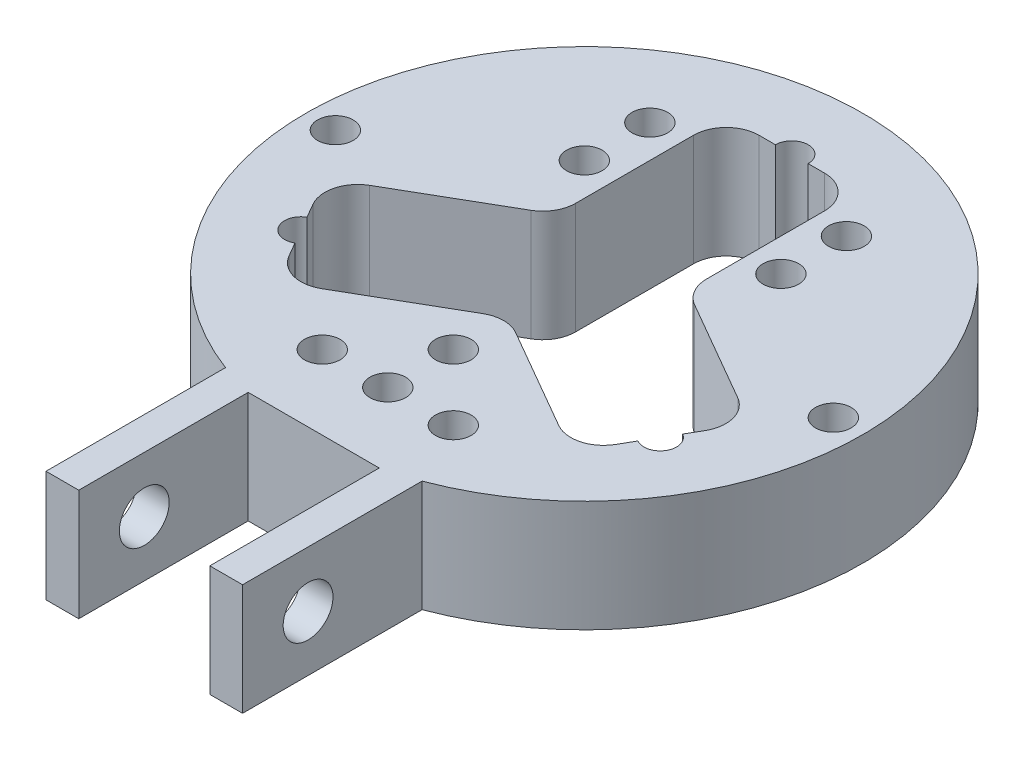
ISO-10303-21;
HEADER;
FILE_DESCRIPTION(('STEP AP214'),'2;1');
FILE_NAME('part.step','',(''),(''),'','','');
FILE_SCHEMA(('AUTOMOTIVE_DESIGN { 1 0 10303 214 1 1 1 1 }'));
ENDSEC;
DATA;
#1=APPLICATION_CONTEXT('core data for automotive mechanical design processes');
#2=APPLICATION_PROTOCOL_DEFINITION('international standard','automotive_design',2000,#1);
#3=PRODUCT_CONTEXT('',#1,'mechanical');
#4=PRODUCT('Part','Part','',(#3));
#5=PRODUCT_RELATED_PRODUCT_CATEGORY('part','',(#4));
#6=PRODUCT_DEFINITION_FORMATION('','',#4);
#7=PRODUCT_DEFINITION_CONTEXT('part definition',#1,'design');
#8=PRODUCT_DEFINITION('design','',#6,#7);
#9=PRODUCT_DEFINITION_SHAPE('','',#8);
#10=(LENGTH_UNIT() NAMED_UNIT(*) SI_UNIT(.MILLI.,.METRE.));
#11=(NAMED_UNIT(*) PLANE_ANGLE_UNIT() SI_UNIT($,.RADIAN.));
#12=(NAMED_UNIT(*) SI_UNIT($,.STERADIAN.) SOLID_ANGLE_UNIT());
#13=UNCERTAINTY_MEASURE_WITH_UNIT(LENGTH_MEASURE(1.E-05),#10,'distance_accuracy_value','');
#14=(GEOMETRIC_REPRESENTATION_CONTEXT(3) GLOBAL_UNCERTAINTY_ASSIGNED_CONTEXT((#13)) GLOBAL_UNIT_ASSIGNED_CONTEXT((#10,
#11,#12)) REPRESENTATION_CONTEXT('',''));
#15=CARTESIAN_POINT('',(0.,0.,0.));
#16=DIRECTION('',(0.,0.,1.));
#17=DIRECTION('',(1.,0.,0.));
#18=AXIS2_PLACEMENT_3D('',#15,#16,#17);
#19=CARTESIAN_POINT('',(0.,10.795,0.));
#20=DIRECTION('',(0.,1.,0.));
#21=DIRECTION('',(0.,0.,1.));
#22=AXIS2_PLACEMENT_3D('',#19,#20,#21);
#23=PLANE('',#22);
#24=CARTESIAN_POINT('',(-9.525,10.795,-9.525));
#25=DIRECTION('',(0.,1.,0.));
#26=DIRECTION('',(0.,0.,1.));
#27=AXIS2_PLACEMENT_3D('',#24,#25,#26);
#28=CIRCLE('',#27,1.7272);
#29=CARTESIAN_POINT('',(-9.525,10.795,-7.7978));
#30=VERTEX_POINT('',#29);
#31=EDGE_CURVE('E690',#30,#30,#28,.T.);
#32=ORIENTED_EDGE('',*,*,#31,.F.);
#33=EDGE_LOOP('',(#32));
#34=FACE_BOUND('',#33,.T.);
#35=CARTESIAN_POINT('',(9.525,10.795,-9.52500000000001));
#36=DIRECTION('',(0.,1.,0.));
#37=DIRECTION('',(0.,0.,1.));
#38=AXIS2_PLACEMENT_3D('',#35,#36,#37);
#39=CIRCLE('',#38,1.7272);
#40=CARTESIAN_POINT('',(9.525,10.795,-7.79780000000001));
#41=VERTEX_POINT('',#40);
#42=EDGE_CURVE('E702',#41,#41,#39,.T.);
#43=ORIENTED_EDGE('',*,*,#42,.F.);
#44=EDGE_LOOP('',(#43));
#45=FACE_BOUND('',#44,.T.);
#46=CARTESIAN_POINT('',(0.,10.795,19.05));
#47=DIRECTION('',(0.,1.,0.));
#48=DIRECTION('',(0.,0.,1.));
#49=AXIS2_PLACEMENT_3D('',#46,#47,#48);
#50=CIRCLE('',#49,1.7272);
#51=CARTESIAN_POINT('',(0.,10.795,20.7772));
#52=VERTEX_POINT('',#51);
#53=EDGE_CURVE('E708',#52,#52,#50,.T.);
#54=ORIENTED_EDGE('',*,*,#53,.F.);
#55=EDGE_LOOP('',(#54));
#56=FACE_BOUND('',#55,.T.);
#57=CARTESIAN_POINT('',(-9.525,10.795,-15.875));
#58=DIRECTION('',(0.,1.,0.));
#59=DIRECTION('',(0.,0.,1.));
#60=AXIS2_PLACEMENT_3D('',#57,#58,#59);
#61=CIRCLE('',#60,1.7272);
#62=CARTESIAN_POINT('',(-9.525,10.795,-14.1478));
#63=VERTEX_POINT('',#62);
#64=EDGE_CURVE('E714',#63,#63,#61,.T.);
#65=ORIENTED_EDGE('',*,*,#64,.F.);
#66=EDGE_LOOP('',(#65));
#67=FACE_BOUND('',#66,.T.);
#68=CARTESIAN_POINT('',(9.525,10.795,-15.875));
#69=DIRECTION('',(0.,1.,0.));
#70=DIRECTION('',(0.,0.,1.));
#71=AXIS2_PLACEMENT_3D('',#68,#69,#70);
#72=CIRCLE('',#71,1.7272);
#73=CARTESIAN_POINT('',(9.525,10.795,-14.1478));
#74=VERTEX_POINT('',#73);
#75=EDGE_CURVE('E720',#74,#74,#72,.T.);
#76=ORIENTED_EDGE('',*,*,#75,.F.);
#77=EDGE_LOOP('',(#76));
#78=FACE_BOUND('',#77,.T.);
#79=CARTESIAN_POINT('',(24.13,10.795,0.));
#80=DIRECTION('',(0.,1.,0.));
#81=DIRECTION('',(0.,0.,1.));
#82=AXIS2_PLACEMENT_3D('',#79,#80,#81);
#83=CIRCLE('',#82,1.7272);
#84=CARTESIAN_POINT('',(24.13,10.795,1.7272));
#85=VERTEX_POINT('',#84);
#86=EDGE_CURVE('E726',#85,#85,#83,.T.);
#87=ORIENTED_EDGE('',*,*,#86,.F.);
#88=EDGE_LOOP('',(#87));
#89=FACE_BOUND('',#88,.T.);
#90=CARTESIAN_POINT('',(-24.13,10.795,0.));
#91=DIRECTION('',(0.,1.,0.));
#92=DIRECTION('',(0.,0.,1.));
#93=AXIS2_PLACEMENT_3D('',#90,#91,#92);
#94=CIRCLE('',#93,1.7272);
#95=CARTESIAN_POINT('',(-24.13,10.795,1.7272));
#96=VERTEX_POINT('',#95);
#97=EDGE_CURVE('E494',#96,#96,#94,.T.);
#98=ORIENTED_EDGE('',*,*,#97,.F.);
#99=EDGE_LOOP('',(#98));
#100=FACE_BOUND('',#99,.T.);
#101=CARTESIAN_POINT('',(-6.35,10.795,19.05));
#102=DIRECTION('',(0.,1.,0.));
#103=DIRECTION('',(0.,0.,1.));
#104=AXIS2_PLACEMENT_3D('',#101,#102,#103);
#105=CIRCLE('',#104,1.7272);
#106=CARTESIAN_POINT('',(-6.35,10.795,20.7772));
#107=VERTEX_POINT('',#106);
#108=EDGE_CURVE('E483',#107,#107,#105,.T.);
#109=ORIENTED_EDGE('',*,*,#108,.F.);
#110=EDGE_LOOP('',(#109));
#111=FACE_BOUND('',#110,.T.);
#112=CARTESIAN_POINT('',(0.,10.795,12.7));
#113=DIRECTION('',(0.,1.,0.));
#114=DIRECTION('',(0.,0.,1.));
#115=AXIS2_PLACEMENT_3D('',#112,#113,#114);
#116=CIRCLE('',#115,1.7272);
#117=CARTESIAN_POINT('',(0.,10.795,14.4272));
#118=VERTEX_POINT('',#117);
#119=EDGE_CURVE('E480',#118,#118,#116,.T.);
#120=ORIENTED_EDGE('',*,*,#119,.F.);
#121=EDGE_LOOP('',(#120));
#122=FACE_BOUND('',#121,.T.);
#123=CARTESIAN_POINT('',(6.35,10.795,19.05));
#124=DIRECTION('',(0.,1.,0.));
#125=DIRECTION('',(0.,0.,1.));
#126=AXIS2_PLACEMENT_3D('',#123,#124,#125);
#127=CIRCLE('',#126,1.7272);
#128=CARTESIAN_POINT('',(6.35,10.795,20.7772));
#129=VERTEX_POINT('',#128);
#130=EDGE_CURVE('E477',#129,#129,#127,.T.);
#131=ORIENTED_EDGE('',*,*,#130,.F.);
#132=EDGE_LOOP('',(#131));
#133=FACE_BOUND('',#132,.T.);
#134=DIRECTION('',(0.,0.,-1.));
#135=VECTOR('',#134,1.);
#136=CARTESIAN_POINT('',(-6.34999999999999,10.795,26.2298047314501));
#137=LINE('',#136,#135);
#138=CARTESIAN_POINT('',(-6.35,10.795,42.6497332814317));
#139=VERTEX_POINT('',#138);
#140=CARTESIAN_POINT('',(-6.34999999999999,10.795,26.2298047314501));
#141=VERTEX_POINT('',#140);
#142=EDGE_CURVE('E422',#139,#141,#137,.T.);
#143=ORIENTED_EDGE('',*,*,#142,.T.);
#144=DIRECTION('',(1.,0.,0.));
#145=VECTOR('',#144,1.);
#146=CARTESIAN_POINT('',(-6.34999999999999,10.795,26.2298047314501));
#147=LINE('',#146,#145);
#148=CARTESIAN_POINT('',(6.35,10.795,26.2298047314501));
#149=VERTEX_POINT('',#148);
#150=EDGE_CURVE('E425',#141,#149,#147,.T.);
#151=ORIENTED_EDGE('',*,*,#150,.T.);
#152=DIRECTION('',(0.,0.,1.));
#153=VECTOR('',#152,1.);
#154=CARTESIAN_POINT('',(6.35,10.795,26.2298047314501));
#155=LINE('',#154,#153);
#156=CARTESIAN_POINT('',(6.35,10.795,42.6497332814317));
#157=VERTEX_POINT('',#156);
#158=EDGE_CURVE('E428',#149,#157,#155,.T.);
#159=ORIENTED_EDGE('',*,*,#158,.T.);
#160=DIRECTION('',(1.,0.,0.));
#161=VECTOR('',#160,1.);
#162=CARTESIAN_POINT('',(9.52500000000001,10.795,42.6497332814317));
#163=LINE('',#162,#161);
#164=CARTESIAN_POINT('',(9.52500000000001,10.795,42.6497332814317));
#165=VERTEX_POINT('',#164);
#166=EDGE_CURVE('E430',#157,#165,#163,.T.);
#167=ORIENTED_EDGE('',*,*,#166,.T.);
#168=DIRECTION('',(0.,0.,-1.));
#169=VECTOR('',#168,1.);
#170=CARTESIAN_POINT('',(9.52500000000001,10.795,25.2507332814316));
#171=LINE('',#170,#169);
#172=CARTESIAN_POINT('',(9.52500000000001,10.795,25.2507332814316));
#173=VERTEX_POINT('',#172);
#174=EDGE_CURVE('E432',#165,#173,#171,.T.);
#175=ORIENTED_EDGE('',*,*,#174,.T.);
#176=CARTESIAN_POINT('',(0.,10.795,0.));
#177=DIRECTION('',(0.,1.,0.));
#178=DIRECTION('',(0.,0.,1.));
#179=AXIS2_PLACEMENT_3D('',#176,#177,#178);
#180=CIRCLE('',#179,26.9875);
#181=CARTESIAN_POINT('',(-9.525,10.795,25.2507332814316));
#182=VERTEX_POINT('',#181);
#183=EDGE_CURVE('E434',#173,#182,#180,.T.);
#184=ORIENTED_EDGE('',*,*,#183,.T.);
#185=DIRECTION('',(0.,0.,1.));
#186=VECTOR('',#185,1.);
#187=CARTESIAN_POINT('',(-9.52499999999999,10.795,25.2507332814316));
#188=LINE('',#187,#186);
#189=CARTESIAN_POINT('',(-9.52499999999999,10.795,42.6497332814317));
#190=VERTEX_POINT('',#189);
#191=EDGE_CURVE('E436',#182,#190,#188,.T.);
#192=ORIENTED_EDGE('',*,*,#191,.T.);
#193=DIRECTION('',(1.,0.,0.));
#194=VECTOR('',#193,1.);
#195=CARTESIAN_POINT('',(-9.52499999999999,10.795,42.6497332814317));
#196=LINE('',#195,#194);
#197=EDGE_CURVE('E438',#190,#139,#196,.T.);
#198=ORIENTED_EDGE('',*,*,#197,.T.);
#199=EDGE_LOOP('',(#143,#151,#159,#167,#175,#184,#192,#198));
#200=FACE_BOUND('',#199,.T.);
#201=DIRECTION('',(0.866025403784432,0.,0.500000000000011));
#202=VECTOR('',#201,1.);
#203=CARTESIAN_POINT('',(1.58749999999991,10.795,8.2488919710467));
#204=LINE('',#203,#202);
#205=CARTESIAN_POINT('',(1.58749999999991,10.795,8.2488919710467));
#206=VERTEX_POINT('',#205);
#207=CARTESIAN_POINT('',(11.4861703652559,10.795,13.9638919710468));
#208=VERTEX_POINT('',#207);
#209=EDGE_CURVE('E251',#206,#208,#204,.T.);
#210=ORIENTED_EDGE('',*,*,#209,.F.);
#211=CARTESIAN_POINT('',(0.,10.795,10.9985226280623));
#212=DIRECTION('',(0.,-1.,0.));
#213=DIRECTION('',(0.,0.,1.));
#214=AXIS2_PLACEMENT_3D('',#211,#212,#213);
#215=CIRCLE('',#214,3.175);
#216=CARTESIAN_POINT('',(-1.58750000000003,10.795,8.24889197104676));
#217=VERTEX_POINT('',#216);
#218=EDGE_CURVE('E243',#217,#206,#215,.T.);
#219=ORIENTED_EDGE('',*,*,#218,.F.);
#220=DIRECTION('',(0.866025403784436,0.,-0.500000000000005));
#221=VECTOR('',#220,1.);
#222=CARTESIAN_POINT('',(-11.486170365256,10.795,13.9638919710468));
#223=LINE('',#222,#221);
#224=CARTESIAN_POINT('',(-11.486170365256,10.795,13.9638919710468));
#225=VERTEX_POINT('',#224);
#226=EDGE_CURVE('E309',#225,#217,#223,.T.);
#227=ORIENTED_EDGE('',*,*,#226,.F.);
#228=CARTESIAN_POINT('',(-13.0736703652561,10.795,11.2142613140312));
#229=DIRECTION('',(0.,1.,0.));
#230=DIRECTION('',(0.,0.,1.));
#231=AXIS2_PLACEMENT_3D('',#228,#229,#230);
#232=CIRCLE('',#231,3.17500000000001);
#233=CARTESIAN_POINT('',(-15.8233010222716,10.795,12.8017613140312));
#234=VERTEX_POINT('',#233);
#235=EDGE_CURVE('E307',#234,#225,#232,.T.);
#236=ORIENTED_EDGE('',*,*,#235,.F.);
#237=DIRECTION('',(0.500000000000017,0.,0.866025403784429));
#238=VECTOR('',#237,1.);
#239=CARTESIAN_POINT('',(-16.6170510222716,10.795,11.4269459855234));
#240=LINE('',#239,#238);
#241=CARTESIAN_POINT('',(-16.6170510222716,10.795,11.4269459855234));
#242=VERTEX_POINT('',#241);
#243=EDGE_CURVE('E305',#242,#234,#240,.T.);
#244=ORIENTED_EDGE('',*,*,#243,.F.);
#245=CARTESIAN_POINT('',(-17.4108010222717,10.795,10.0521306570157));
#246=DIRECTION('',(0.,1.,0.));
#247=DIRECTION('',(0.,0.,1.));
#248=AXIS2_PLACEMENT_3D('',#245,#246,#247);
#249=CIRCLE('',#248,1.5875);
#250=CARTESIAN_POINT('',(-18.2045510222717,10.795,8.67731532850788));
#251=VERTEX_POINT('',#250);
#252=EDGE_CURVE('E303',#251,#242,#249,.T.);
#253=ORIENTED_EDGE('',*,*,#252,.F.);
#254=DIRECTION('',(0.500000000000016,0.,0.866025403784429));
#255=VECTOR('',#254,1.);
#256=CARTESIAN_POINT('',(-18.9983010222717,10.795,7.3025000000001));
#257=LINE('',#256,#255);
#258=CARTESIAN_POINT('',(-18.9983010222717,10.795,7.30250000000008));
#259=VERTEX_POINT('',#258);
#260=EDGE_CURVE('E301',#259,#251,#257,.T.);
#261=ORIENTED_EDGE('',*,*,#260,.F.);
#262=CARTESIAN_POINT('',(-16.2486703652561,10.795,5.715));
#263=DIRECTION('',(0.,1.,0.));
#264=DIRECTION('',(0.,0.,-1.));
#265=AXIS2_PLACEMENT_3D('',#262,#263,#264);
#266=CIRCLE('',#265,3.175);
#267=CARTESIAN_POINT('',(-17.8361703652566,10.795,2.96536934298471));
#268=VERTEX_POINT('',#267);
#269=EDGE_CURVE('E299',#268,#259,#266,.T.);
#270=ORIENTED_EDGE('',*,*,#269,.F.);
#271=DIRECTION('',(-0.866025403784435,0.,0.500000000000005));
#272=VECTOR('',#271,1.);
#273=CARTESIAN_POINT('',(-7.93750000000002,10.795,-2.74963065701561));
#274=LINE('',#273,#272);
#275=CARTESIAN_POINT('',(-7.93750000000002,10.795,-2.74963065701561));
#276=VERTEX_POINT('',#275);
#277=EDGE_CURVE('E297',#276,#268,#274,.T.);
#278=ORIENTED_EDGE('',*,*,#277,.F.);
#279=CARTESIAN_POINT('',(-9.52499999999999,10.795,-5.49926131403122));
#280=DIRECTION('',(0.,-1.,0.));
#281=DIRECTION('',(0.,0.,1.));
#282=AXIS2_PLACEMENT_3D('',#279,#280,#281);
#283=CIRCLE('',#282,3.175);
#284=CARTESIAN_POINT('',(-6.34999999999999,10.795,-5.49926131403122));
#285=VERTEX_POINT('',#284);
#286=EDGE_CURVE('E295',#285,#276,#283,.T.);
#287=ORIENTED_EDGE('',*,*,#286,.F.);
#288=DIRECTION('',(0.,0.,1.));
#289=VECTOR('',#288,1.);
#290=CARTESIAN_POINT('',(-6.34999999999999,10.795,-16.9292613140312));
#291=LINE('',#290,#289);
#292=CARTESIAN_POINT('',(-6.35,10.795,-16.9292613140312));
#293=VERTEX_POINT('',#292);
#294=EDGE_CURVE('E293',#293,#285,#291,.T.);
#295=ORIENTED_EDGE('',*,*,#294,.F.);
#296=CARTESIAN_POINT('',(-3.17499999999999,10.795,-16.9292613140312));
#297=DIRECTION('',(0.,1.,0.));
#298=DIRECTION('',(0.,0.,-1.));
#299=AXIS2_PLACEMENT_3D('',#296,#297,#298);
#300=CIRCLE('',#299,3.175);
#301=CARTESIAN_POINT('',(-3.17499999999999,10.795,-20.1042613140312));
#302=VERTEX_POINT('',#301);
#303=EDGE_CURVE('E291',#302,#293,#300,.T.);
#304=ORIENTED_EDGE('',*,*,#303,.F.);
#305=DIRECTION('',(-1.,0.,0.));
#306=VECTOR('',#305,1.);
#307=CARTESIAN_POINT('',(-3.17499999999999,10.795,-20.1042613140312));
#308=LINE('',#307,#306);
#309=CARTESIAN_POINT('',(-1.5875,10.795,-20.1042613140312));
#310=VERTEX_POINT('',#309);
#311=EDGE_CURVE('E289',#310,#302,#308,.T.);
#312=ORIENTED_EDGE('',*,*,#311,.F.);
#313=CARTESIAN_POINT('',(0.,10.795,-20.1042613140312));
#314=DIRECTION('',(0.,1.,0.));
#315=DIRECTION('',(0.,0.,1.));
#316=AXIS2_PLACEMENT_3D('',#313,#314,#315);
#317=CIRCLE('',#316,1.5875);
#318=CARTESIAN_POINT('',(1.5875,10.795,-20.1042613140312));
#319=VERTEX_POINT('',#318);
#320=EDGE_CURVE('E287',#319,#310,#317,.T.);
#321=ORIENTED_EDGE('',*,*,#320,.F.);
#322=DIRECTION('',(-1.,0.,0.));
#323=VECTOR('',#322,1.);
#324=CARTESIAN_POINT('',(1.5875,10.795,-20.1042613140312));
#325=LINE('',#324,#323);
#326=CARTESIAN_POINT('',(3.17500000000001,10.795,-20.1042613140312));
#327=VERTEX_POINT('',#326);
#328=EDGE_CURVE('E285',#327,#319,#325,.T.);
#329=ORIENTED_EDGE('',*,*,#328,.F.);
#330=CARTESIAN_POINT('',(3.17500000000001,10.795,-16.9292613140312));
#331=DIRECTION('',(0.,1.,0.));
#332=DIRECTION('',(0.,0.,1.));
#333=AXIS2_PLACEMENT_3D('',#330,#331,#332);
#334=CIRCLE('',#333,3.175);
#335=CARTESIAN_POINT('',(6.35,10.795,-16.9292613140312));
#336=VERTEX_POINT('',#335);
#337=EDGE_CURVE('E283',#336,#327,#334,.T.);
#338=ORIENTED_EDGE('',*,*,#337,.F.);
#339=DIRECTION('',(0.,0.,-1.));
#340=VECTOR('',#339,1.);
#341=CARTESIAN_POINT('',(6.35,10.795,-5.49926131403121));
#342=LINE('',#341,#340);
#343=CARTESIAN_POINT('',(6.35,10.795,-5.49926131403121));
#344=VERTEX_POINT('',#343);
#345=EDGE_CURVE('E281',#344,#336,#342,.T.);
#346=ORIENTED_EDGE('',*,*,#345,.F.);
#347=CARTESIAN_POINT('',(9.52500000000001,10.795,-5.49926131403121));
#348=DIRECTION('',(0.,-1.,0.));
#349=DIRECTION('',(0.,0.,-1.));
#350=AXIS2_PLACEMENT_3D('',#347,#348,#349);
#351=CIRCLE('',#350,3.175);
#352=CARTESIAN_POINT('',(7.93749999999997,10.795,-2.74963065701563));
#353=VERTEX_POINT('',#352);
#354=EDGE_CURVE('E279',#353,#344,#351,.T.);
#355=ORIENTED_EDGE('',*,*,#354,.F.);
#356=DIRECTION('',(-0.866025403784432,0.,-0.500000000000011));
#357=VECTOR('',#356,1.);
#358=CARTESIAN_POINT('',(17.836170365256,10.795,2.96536934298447));
#359=LINE('',#358,#357);
#360=CARTESIAN_POINT('',(17.836170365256,10.795,2.96536934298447));
#361=VERTEX_POINT('',#360);
#362=EDGE_CURVE('E277',#361,#353,#359,.T.);
#363=ORIENTED_EDGE('',*,*,#362,.F.);
#364=CARTESIAN_POINT('',(16.248670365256,10.795,5.71500000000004));
#365=DIRECTION('',(0.,1.,0.));
#366=DIRECTION('',(0.,0.,1.));
#367=AXIS2_PLACEMENT_3D('',#364,#365,#366);
#368=CIRCLE('',#367,3.17499999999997);
#369=CARTESIAN_POINT('',(18.9983010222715,10.795,7.30250000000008));
#370=VERTEX_POINT('',#369);
#371=EDGE_CURVE('E275',#370,#361,#368,.T.);
#372=ORIENTED_EDGE('',*,*,#371,.F.);
#373=DIRECTION('',(0.500000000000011,0.,-0.866025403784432));
#374=VECTOR('',#373,1.);
#375=CARTESIAN_POINT('',(18.9983010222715,10.795,7.30250000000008));
#376=LINE('',#375,#374);
#377=CARTESIAN_POINT('',(18.2045510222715,10.795,8.6773153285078));
#378=VERTEX_POINT('',#377);
#379=EDGE_CURVE('E273',#378,#370,#376,.T.);
#380=ORIENTED_EDGE('',*,*,#379,.F.);
#381=CARTESIAN_POINT('',(17.4108010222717,10.795,10.0521306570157));
#382=DIRECTION('',(0.,1.,0.));
#383=DIRECTION('',(0.,0.,1.));
#384=AXIS2_PLACEMENT_3D('',#381,#382,#383);
#385=CIRCLE('',#384,1.5875);
#386=CARTESIAN_POINT('',(16.6170510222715,10.795,11.4269459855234));
#387=VERTEX_POINT('',#386);
#388=EDGE_CURVE('E271',#387,#378,#385,.T.);
#389=ORIENTED_EDGE('',*,*,#388,.F.);
#390=DIRECTION('',(0.500000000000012,0.,-0.866025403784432));
#391=VECTOR('',#390,1.);
#392=CARTESIAN_POINT('',(16.6170510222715,10.795,11.4269459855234));
#393=LINE('',#392,#391);
#394=CARTESIAN_POINT('',(15.8233010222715,10.795,12.8017613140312));
#395=VERTEX_POINT('',#394);
#396=EDGE_CURVE('E266',#395,#387,#393,.T.);
#397=ORIENTED_EDGE('',*,*,#396,.F.);
#398=CARTESIAN_POINT('',(13.0736703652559,10.795,11.2142613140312));
#399=DIRECTION('',(0.,1.,0.));
#400=DIRECTION('',(0.,0.,-1.));
#401=AXIS2_PLACEMENT_3D('',#398,#399,#400);
#402=CIRCLE('',#401,3.17499999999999);
#403=EDGE_CURVE('E264',#208,#395,#402,.T.);
#404=ORIENTED_EDGE('',*,*,#403,.F.);
#405=EDGE_LOOP('',(#210,#219,#227,#236,#244,#253,#261,#270,#278,#287,#295,#304,#312,#321,#329,
#338,#346,#355,#363,#372,#380,#389,#397,#404));
#406=FACE_BOUND('',#405,.T.);
#407=ADVANCED_FACE('F32',(#34,#45,#56,#67,#78,#89,#100,#111,#122,#133,#200,#406),#23,.T.);
#408=CARTESIAN_POINT('',(0.,0.,0.));
#409=DIRECTION('',(0.,1.,0.));
#410=DIRECTION('',(0.,0.,1.));
#411=AXIS2_PLACEMENT_3D('',#408,#409,#410);
#412=PLANE('',#411);
#413=CARTESIAN_POINT('',(-9.525,0.,-9.525));
#414=DIRECTION('',(0.,1.,0.));
#415=DIRECTION('',(0.,0.,1.));
#416=AXIS2_PLACEMENT_3D('',#413,#414,#415);
#417=CIRCLE('',#416,1.7272);
#418=CARTESIAN_POINT('',(-9.525,0.,-7.7978));
#419=VERTEX_POINT('',#418);
#420=EDGE_CURVE('E694',#419,#419,#417,.T.);
#421=ORIENTED_EDGE('',*,*,#420,.T.);
#422=EDGE_LOOP('',(#421));
#423=FACE_BOUND('',#422,.T.);
#424=CARTESIAN_POINT('',(9.525,0.,-9.52500000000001));
#425=DIRECTION('',(0.,1.,0.));
#426=DIRECTION('',(0.,0.,1.));
#427=AXIS2_PLACEMENT_3D('',#424,#425,#426);
#428=CIRCLE('',#427,1.7272);
#429=CARTESIAN_POINT('',(9.525,0.,-7.79780000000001));
#430=VERTEX_POINT('',#429);
#431=EDGE_CURVE('E705',#430,#430,#428,.T.);
#432=ORIENTED_EDGE('',*,*,#431,.T.);
#433=EDGE_LOOP('',(#432));
#434=FACE_BOUND('',#433,.T.);
#435=CARTESIAN_POINT('',(0.,0.,19.05));
#436=DIRECTION('',(0.,1.,0.));
#437=DIRECTION('',(0.,0.,1.));
#438=AXIS2_PLACEMENT_3D('',#435,#436,#437);
#439=CIRCLE('',#438,1.7272);
#440=CARTESIAN_POINT('',(0.,0.,20.7772));
#441=VERTEX_POINT('',#440);
#442=EDGE_CURVE('E711',#441,#441,#439,.T.);
#443=ORIENTED_EDGE('',*,*,#442,.T.);
#444=EDGE_LOOP('',(#443));
#445=FACE_BOUND('',#444,.T.);
#446=CARTESIAN_POINT('',(-9.525,0.,-15.875));
#447=DIRECTION('',(0.,1.,0.));
#448=DIRECTION('',(0.,0.,1.));
#449=AXIS2_PLACEMENT_3D('',#446,#447,#448);
#450=CIRCLE('',#449,1.7272);
#451=CARTESIAN_POINT('',(-9.525,0.,-14.1478));
#452=VERTEX_POINT('',#451);
#453=EDGE_CURVE('E717',#452,#452,#450,.T.);
#454=ORIENTED_EDGE('',*,*,#453,.T.);
#455=EDGE_LOOP('',(#454));
#456=FACE_BOUND('',#455,.T.);
#457=CARTESIAN_POINT('',(9.525,0.,-15.875));
#458=DIRECTION('',(0.,1.,0.));
#459=DIRECTION('',(0.,0.,1.));
#460=AXIS2_PLACEMENT_3D('',#457,#458,#459);
#461=CIRCLE('',#460,1.7272);
#462=CARTESIAN_POINT('',(9.525,0.,-14.1478));
#463=VERTEX_POINT('',#462);
#464=EDGE_CURVE('E723',#463,#463,#461,.T.);
#465=ORIENTED_EDGE('',*,*,#464,.T.);
#466=EDGE_LOOP('',(#465));
#467=FACE_BOUND('',#466,.T.);
#468=CARTESIAN_POINT('',(24.13,0.,0.));
#469=DIRECTION('',(0.,1.,0.));
#470=DIRECTION('',(0.,0.,1.));
#471=AXIS2_PLACEMENT_3D('',#468,#469,#470);
#472=CIRCLE('',#471,1.7272);
#473=CARTESIAN_POINT('',(24.13,0.,1.7272));
#474=VERTEX_POINT('',#473);
#475=EDGE_CURVE('E729',#474,#474,#472,.T.);
#476=ORIENTED_EDGE('',*,*,#475,.T.);
#477=EDGE_LOOP('',(#476));
#478=FACE_BOUND('',#477,.T.);
#479=CARTESIAN_POINT('',(-24.13,0.,0.));
#480=DIRECTION('',(0.,1.,0.));
#481=DIRECTION('',(0.,0.,1.));
#482=AXIS2_PLACEMENT_3D('',#479,#480,#481);
#483=CIRCLE('',#482,1.7272);
#484=CARTESIAN_POINT('',(-24.13,0.,1.7272));
#485=VERTEX_POINT('',#484);
#486=EDGE_CURVE('E489',#485,#485,#483,.T.);
#487=ORIENTED_EDGE('',*,*,#486,.T.);
#488=EDGE_LOOP('',(#487));
#489=FACE_BOUND('',#488,.T.);
#490=CARTESIAN_POINT('',(-6.35,0.,19.05));
#491=DIRECTION('',(0.,1.,0.));
#492=DIRECTION('',(0.,0.,1.));
#493=AXIS2_PLACEMENT_3D('',#490,#491,#492);
#494=CIRCLE('',#493,1.7272);
#495=CARTESIAN_POINT('',(-6.35,0.,20.7772));
#496=VERTEX_POINT('',#495);
#497=EDGE_CURVE('E481',#496,#496,#494,.T.);
#498=ORIENTED_EDGE('',*,*,#497,.T.);
#499=EDGE_LOOP('',(#498));
#500=FACE_BOUND('',#499,.T.);
#501=CARTESIAN_POINT('',(0.,0.,12.7));
#502=DIRECTION('',(0.,1.,0.));
#503=DIRECTION('',(0.,0.,1.));
#504=AXIS2_PLACEMENT_3D('',#501,#502,#503);
#505=CIRCLE('',#504,1.7272);
#506=CARTESIAN_POINT('',(0.,0.,14.4272));
#507=VERTEX_POINT('',#506);
#508=EDGE_CURVE('E478',#507,#507,#505,.T.);
#509=ORIENTED_EDGE('',*,*,#508,.T.);
#510=EDGE_LOOP('',(#509));
#511=FACE_BOUND('',#510,.T.);
#512=CARTESIAN_POINT('',(6.35,0.,19.05));
#513=DIRECTION('',(0.,1.,0.));
#514=DIRECTION('',(0.,0.,1.));
#515=AXIS2_PLACEMENT_3D('',#512,#513,#514);
#516=CIRCLE('',#515,1.7272);
#517=CARTESIAN_POINT('',(6.35,0.,20.7772));
#518=VERTEX_POINT('',#517);
#519=EDGE_CURVE('E312',#518,#518,#516,.T.);
#520=ORIENTED_EDGE('',*,*,#519,.T.);
#521=EDGE_LOOP('',(#520));
#522=FACE_BOUND('',#521,.T.);
#523=DIRECTION('',(0.,0.,-1.));
#524=VECTOR('',#523,1.);
#525=CARTESIAN_POINT('',(-6.34999999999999,0.,26.2298047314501));
#526=LINE('',#525,#524);
#527=CARTESIAN_POINT('',(-6.35,0.,42.6497332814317));
#528=VERTEX_POINT('',#527);
#529=CARTESIAN_POINT('',(-6.34999999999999,0.,26.2298047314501));
#530=VERTEX_POINT('',#529);
#531=EDGE_CURVE('E259',#528,#530,#526,.T.);
#532=ORIENTED_EDGE('',*,*,#531,.F.);
#533=DIRECTION('',(1.,0.,0.));
#534=VECTOR('',#533,1.);
#535=CARTESIAN_POINT('',(-9.52499999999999,0.,42.6497332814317));
#536=LINE('',#535,#534);
#537=CARTESIAN_POINT('',(-9.52499999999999,0.,42.6497332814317));
#538=VERTEX_POINT('',#537);
#539=EDGE_CURVE('E426',#538,#528,#536,.T.);
#540=ORIENTED_EDGE('',*,*,#539,.F.);
#541=DIRECTION('',(0.,0.,1.));
#542=VECTOR('',#541,1.);
#543=CARTESIAN_POINT('',(-9.52499999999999,0.,25.2507332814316));
#544=LINE('',#543,#542);
#545=CARTESIAN_POINT('',(-9.525,0.,25.2507332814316));
#546=VERTEX_POINT('',#545);
#547=EDGE_CURVE('E453',#546,#538,#544,.T.);
#548=ORIENTED_EDGE('',*,*,#547,.F.);
#549=CARTESIAN_POINT('',(0.,0.,0.));
#550=DIRECTION('',(0.,1.,0.));
#551=DIRECTION('',(0.,0.,1.));
#552=AXIS2_PLACEMENT_3D('',#549,#550,#551);
#553=CIRCLE('',#552,26.9875);
#554=CARTESIAN_POINT('',(9.52500000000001,0.,25.2507332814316));
#555=VERTEX_POINT('',#554);
#556=EDGE_CURVE('E451',#555,#546,#553,.T.);
#557=ORIENTED_EDGE('',*,*,#556,.F.);
#558=DIRECTION('',(0.,0.,-1.));
#559=VECTOR('',#558,1.);
#560=CARTESIAN_POINT('',(9.52500000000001,0.,25.2507332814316));
#561=LINE('',#560,#559);
#562=CARTESIAN_POINT('',(9.52500000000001,0.,42.6497332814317));
#563=VERTEX_POINT('',#562);
#564=EDGE_CURVE('E449',#563,#555,#561,.T.);
#565=ORIENTED_EDGE('',*,*,#564,.F.);
#566=DIRECTION('',(1.,0.,0.));
#567=VECTOR('',#566,1.);
#568=CARTESIAN_POINT('',(9.52500000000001,0.,42.6497332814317));
#569=LINE('',#568,#567);
#570=CARTESIAN_POINT('',(6.35,0.,42.6497332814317));
#571=VERTEX_POINT('',#570);
#572=EDGE_CURVE('E447',#571,#563,#569,.T.);
#573=ORIENTED_EDGE('',*,*,#572,.F.);
#574=DIRECTION('',(0.,0.,1.));
#575=VECTOR('',#574,1.);
#576=CARTESIAN_POINT('',(6.35,0.,26.2298047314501));
#577=LINE('',#576,#575);
#578=CARTESIAN_POINT('',(6.35,0.,26.2298047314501));
#579=VERTEX_POINT('',#578);
#580=EDGE_CURVE('E445',#579,#571,#577,.T.);
#581=ORIENTED_EDGE('',*,*,#580,.F.);
#582=DIRECTION('',(1.,0.,0.));
#583=VECTOR('',#582,1.);
#584=CARTESIAN_POINT('',(-6.34999999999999,0.,26.2298047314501));
#585=LINE('',#584,#583);
#586=EDGE_CURVE('E443',#530,#579,#585,.T.);
#587=ORIENTED_EDGE('',*,*,#586,.F.);
#588=EDGE_LOOP('',(#532,#540,#548,#557,#565,#573,#581,#587));
#589=FACE_BOUND('',#588,.T.);
#590=CARTESIAN_POINT('',(0.,0.,10.9985226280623));
#591=DIRECTION('',(0.,-1.,0.));
#592=DIRECTION('',(0.,0.,1.));
#593=AXIS2_PLACEMENT_3D('',#590,#591,#592);
#594=CIRCLE('',#593,3.175);
#595=CARTESIAN_POINT('',(-1.58750000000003,0.,8.24889197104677));
#596=VERTEX_POINT('',#595);
#597=CARTESIAN_POINT('',(1.58749999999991,0.,8.2488919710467));
#598=VERTEX_POINT('',#597);
#599=EDGE_CURVE('E57',#596,#598,#594,.T.);
#600=ORIENTED_EDGE('',*,*,#599,.T.);
#601=DIRECTION('',(0.866025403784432,0.,0.500000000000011));
#602=VECTOR('',#601,1.);
#603=CARTESIAN_POINT('',(1.58749999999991,0.,8.2488919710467));
#604=LINE('',#603,#602);
#605=CARTESIAN_POINT('',(11.4861703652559,0.,13.9638919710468));
#606=VERTEX_POINT('',#605);
#607=EDGE_CURVE('E258',#598,#606,#604,.T.);
#608=ORIENTED_EDGE('',*,*,#607,.T.);
#609=CARTESIAN_POINT('',(13.0736703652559,0.,11.2142613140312));
#610=DIRECTION('',(0.,1.,0.));
#611=DIRECTION('',(0.,0.,-1.));
#612=AXIS2_PLACEMENT_3D('',#609,#610,#611);
#613=CIRCLE('',#612,3.17499999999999);
#614=CARTESIAN_POINT('',(15.8233010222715,0.,12.8017613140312));
#615=VERTEX_POINT('',#614);
#616=EDGE_CURVE('E314',#606,#615,#613,.T.);
#617=ORIENTED_EDGE('',*,*,#616,.T.);
#618=DIRECTION('',(0.500000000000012,0.,-0.866025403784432));
#619=VECTOR('',#618,1.);
#620=CARTESIAN_POINT('',(16.6170510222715,0.,11.4269459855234));
#621=LINE('',#620,#619);
#622=CARTESIAN_POINT('',(16.6170510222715,0.,11.4269459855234));
#623=VERTEX_POINT('',#622);
#624=EDGE_CURVE('E317',#615,#623,#621,.T.);
#625=ORIENTED_EDGE('',*,*,#624,.T.);
#626=CARTESIAN_POINT('',(17.4108010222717,0.,10.0521306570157));
#627=DIRECTION('',(0.,1.,0.));
#628=DIRECTION('',(0.,0.,1.));
#629=AXIS2_PLACEMENT_3D('',#626,#627,#628);
#630=CIRCLE('',#629,1.5875);
#631=CARTESIAN_POINT('',(18.2045510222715,0.,8.6773153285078));
#632=VERTEX_POINT('',#631);
#633=EDGE_CURVE('E320',#623,#632,#630,.T.);
#634=ORIENTED_EDGE('',*,*,#633,.T.);
#635=DIRECTION('',(0.500000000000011,0.,-0.866025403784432));
#636=VECTOR('',#635,1.);
#637=CARTESIAN_POINT('',(18.9983010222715,0.,7.30250000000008));
#638=LINE('',#637,#636);
#639=CARTESIAN_POINT('',(18.9983010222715,0.,7.30250000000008));
#640=VERTEX_POINT('',#639);
#641=EDGE_CURVE('E323',#632,#640,#638,.T.);
#642=ORIENTED_EDGE('',*,*,#641,.T.);
#643=CARTESIAN_POINT('',(16.248670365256,0.,5.71500000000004));
#644=DIRECTION('',(0.,1.,0.));
#645=DIRECTION('',(0.,0.,1.));
#646=AXIS2_PLACEMENT_3D('',#643,#644,#645);
#647=CIRCLE('',#646,3.17499999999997);
#648=CARTESIAN_POINT('',(17.836170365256,0.,2.96536934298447));
#649=VERTEX_POINT('',#648);
#650=EDGE_CURVE('E326',#640,#649,#647,.T.);
#651=ORIENTED_EDGE('',*,*,#650,.T.);
#652=DIRECTION('',(-0.866025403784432,0.,-0.500000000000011));
#653=VECTOR('',#652,1.);
#654=CARTESIAN_POINT('',(17.836170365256,0.,2.96536934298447));
#655=LINE('',#654,#653);
#656=CARTESIAN_POINT('',(7.93749999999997,0.,-2.74963065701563));
#657=VERTEX_POINT('',#656);
#658=EDGE_CURVE('E329',#649,#657,#655,.T.);
#659=ORIENTED_EDGE('',*,*,#658,.T.);
#660=CARTESIAN_POINT('',(9.52500000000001,0.,-5.49926131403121));
#661=DIRECTION('',(0.,-1.,0.));
#662=DIRECTION('',(0.,0.,-1.));
#663=AXIS2_PLACEMENT_3D('',#660,#661,#662);
#664=CIRCLE('',#663,3.175);
#665=CARTESIAN_POINT('',(6.35,0.,-5.49926131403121));
#666=VERTEX_POINT('',#665);
#667=EDGE_CURVE('E332',#657,#666,#664,.T.);
#668=ORIENTED_EDGE('',*,*,#667,.T.);
#669=DIRECTION('',(0.,0.,-1.));
#670=VECTOR('',#669,1.);
#671=CARTESIAN_POINT('',(6.35,0.,-5.49926131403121));
#672=LINE('',#671,#670);
#673=CARTESIAN_POINT('',(6.35,0.,-16.9292613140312));
#674=VERTEX_POINT('',#673);
#675=EDGE_CURVE('E335',#666,#674,#672,.T.);
#676=ORIENTED_EDGE('',*,*,#675,.T.);
#677=CARTESIAN_POINT('',(3.17500000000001,0.,-16.9292613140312));
#678=DIRECTION('',(0.,1.,0.));
#679=DIRECTION('',(0.,0.,1.));
#680=AXIS2_PLACEMENT_3D('',#677,#678,#679);
#681=CIRCLE('',#680,3.175);
#682=CARTESIAN_POINT('',(3.17500000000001,0.,-20.1042613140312));
#683=VERTEX_POINT('',#682);
#684=EDGE_CURVE('E338',#674,#683,#681,.T.);
#685=ORIENTED_EDGE('',*,*,#684,.T.);
#686=DIRECTION('',(-1.,0.,0.));
#687=VECTOR('',#686,1.);
#688=CARTESIAN_POINT('',(1.5875,0.,-20.1042613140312));
#689=LINE('',#688,#687);
#690=CARTESIAN_POINT('',(1.5875,0.,-20.1042613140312));
#691=VERTEX_POINT('',#690);
#692=EDGE_CURVE('E341',#683,#691,#689,.T.);
#693=ORIENTED_EDGE('',*,*,#692,.T.);
#694=CARTESIAN_POINT('',(0.,0.,-20.1042613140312));
#695=DIRECTION('',(0.,1.,0.));
#696=DIRECTION('',(0.,0.,1.));
#697=AXIS2_PLACEMENT_3D('',#694,#695,#696);
#698=CIRCLE('',#697,1.5875);
#699=CARTESIAN_POINT('',(-1.5875,0.,-20.1042613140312));
#700=VERTEX_POINT('',#699);
#701=EDGE_CURVE('E344',#691,#700,#698,.T.);
#702=ORIENTED_EDGE('',*,*,#701,.T.);
#703=DIRECTION('',(-1.,0.,0.));
#704=VECTOR('',#703,1.);
#705=CARTESIAN_POINT('',(-3.17499999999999,0.,-20.1042613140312));
#706=LINE('',#705,#704);
#707=CARTESIAN_POINT('',(-3.17499999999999,0.,-20.1042613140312));
#708=VERTEX_POINT('',#707);
#709=EDGE_CURVE('E347',#700,#708,#706,.T.);
#710=ORIENTED_EDGE('',*,*,#709,.T.);
#711=CARTESIAN_POINT('',(-3.17499999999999,0.,-16.9292613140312));
#712=DIRECTION('',(0.,1.,0.));
#713=DIRECTION('',(0.,0.,-1.));
#714=AXIS2_PLACEMENT_3D('',#711,#712,#713);
#715=CIRCLE('',#714,3.175);
#716=CARTESIAN_POINT('',(-6.35,0.,-16.9292613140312));
#717=VERTEX_POINT('',#716);
#718=EDGE_CURVE('E350',#708,#717,#715,.T.);
#719=ORIENTED_EDGE('',*,*,#718,.T.);
#720=DIRECTION('',(0.,0.,1.));
#721=VECTOR('',#720,1.);
#722=CARTESIAN_POINT('',(-6.34999999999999,0.,-16.9292613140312));
#723=LINE('',#722,#721);
#724=CARTESIAN_POINT('',(-6.34999999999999,0.,-5.49926131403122));
#725=VERTEX_POINT('',#724);
#726=EDGE_CURVE('E353',#717,#725,#723,.T.);
#727=ORIENTED_EDGE('',*,*,#726,.T.);
#728=CARTESIAN_POINT('',(-9.52499999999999,0.,-5.49926131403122));
#729=DIRECTION('',(0.,-1.,0.));
#730=DIRECTION('',(0.,0.,1.));
#731=AXIS2_PLACEMENT_3D('',#728,#729,#730);
#732=CIRCLE('',#731,3.175);
#733=CARTESIAN_POINT('',(-7.93750000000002,0.,-2.74963065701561));
#734=VERTEX_POINT('',#733);
#735=EDGE_CURVE('E356',#725,#734,#732,.T.);
#736=ORIENTED_EDGE('',*,*,#735,.T.);
#737=DIRECTION('',(-0.866025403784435,0.,0.500000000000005));
#738=VECTOR('',#737,1.);
#739=CARTESIAN_POINT('',(-7.93750000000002,0.,-2.74963065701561));
#740=LINE('',#739,#738);
#741=CARTESIAN_POINT('',(-17.8361703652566,0.,2.96536934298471));
#742=VERTEX_POINT('',#741);
#743=EDGE_CURVE('E359',#734,#742,#740,.T.);
#744=ORIENTED_EDGE('',*,*,#743,.T.);
#745=CARTESIAN_POINT('',(-16.2486703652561,0.,5.715));
#746=DIRECTION('',(0.,1.,0.));
#747=DIRECTION('',(0.,0.,-1.));
#748=AXIS2_PLACEMENT_3D('',#745,#746,#747);
#749=CIRCLE('',#748,3.175);
#750=CARTESIAN_POINT('',(-18.9983010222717,0.,7.30250000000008));
#751=VERTEX_POINT('',#750);
#752=EDGE_CURVE('E362',#742,#751,#749,.T.);
#753=ORIENTED_EDGE('',*,*,#752,.T.);
#754=DIRECTION('',(0.500000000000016,0.,0.866025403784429));
#755=VECTOR('',#754,1.);
#756=CARTESIAN_POINT('',(-18.9983010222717,0.,7.3025000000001));
#757=LINE('',#756,#755);
#758=CARTESIAN_POINT('',(-18.2045510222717,0.,8.67731532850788));
#759=VERTEX_POINT('',#758);
#760=EDGE_CURVE('E365',#751,#759,#757,.T.);
#761=ORIENTED_EDGE('',*,*,#760,.T.);
#762=CARTESIAN_POINT('',(-17.4108010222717,0.,10.0521306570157));
#763=DIRECTION('',(0.,1.,0.));
#764=DIRECTION('',(0.,0.,1.));
#765=AXIS2_PLACEMENT_3D('',#762,#763,#764);
#766=CIRCLE('',#765,1.5875);
#767=CARTESIAN_POINT('',(-16.6170510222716,0.,11.4269459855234));
#768=VERTEX_POINT('',#767);
#769=EDGE_CURVE('E368',#759,#768,#766,.T.);
#770=ORIENTED_EDGE('',*,*,#769,.T.);
#771=DIRECTION('',(0.500000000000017,0.,0.866025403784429));
#772=VECTOR('',#771,1.);
#773=CARTESIAN_POINT('',(-16.6170510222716,0.,11.4269459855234));
#774=LINE('',#773,#772);
#775=CARTESIAN_POINT('',(-15.8233010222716,0.,12.8017613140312));
#776=VERTEX_POINT('',#775);
#777=EDGE_CURVE('E371',#768,#776,#774,.T.);
#778=ORIENTED_EDGE('',*,*,#777,.T.);
#779=CARTESIAN_POINT('',(-13.0736703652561,0.,11.2142613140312));
#780=DIRECTION('',(0.,1.,0.));
#781=DIRECTION('',(0.,0.,1.));
#782=AXIS2_PLACEMENT_3D('',#779,#780,#781);
#783=CIRCLE('',#782,3.17500000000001);
#784=CARTESIAN_POINT('',(-11.486170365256,0.,13.9638919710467));
#785=VERTEX_POINT('',#784);
#786=EDGE_CURVE('E374',#776,#785,#783,.T.);
#787=ORIENTED_EDGE('',*,*,#786,.T.);
#788=DIRECTION('',(0.866025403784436,0.,-0.500000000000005));
#789=VECTOR('',#788,1.);
#790=CARTESIAN_POINT('',(-11.486170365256,0.,13.9638919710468));
#791=LINE('',#790,#789);
#792=EDGE_CURVE('E252',#785,#596,#791,.T.);
#793=ORIENTED_EDGE('',*,*,#792,.T.);
#794=EDGE_LOOP('',(#600,#608,#617,#625,#634,#642,#651,#659,#668,#676,#685,#693,#702,#710,#719,
#727,#736,#744,#753,#761,#770,#778,#787,#793));
#795=FACE_BOUND('',#794,.T.);
#796=ADVANCED_FACE('F505',(#423,#434,#445,#456,#467,#478,#489,#500,#511,#522,#589,#795),#412,.F.);
#797=CARTESIAN_POINT('',(-6.34999999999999,10.795,26.2298047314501));
#798=DIRECTION('',(-1.,0.,0.));
#799=DIRECTION('',(0.,0.,1.));
#800=AXIS2_PLACEMENT_3D('',#797,#798,#799);
#801=PLANE('',#800);
#802=CARTESIAN_POINT('',(-6.34999999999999,5.3975,36.2997332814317));
#803=DIRECTION('',(-1.,0.,0.));
#804=DIRECTION('',(0.,0.,1.));
#805=AXIS2_PLACEMENT_3D('',#802,#803,#804);
#806=CIRCLE('',#805,2.413);
#807=CARTESIAN_POINT('',(-6.34999999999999,5.3975,38.7127332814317));
#808=VERTEX_POINT('',#807);
#809=EDGE_CURVE('E688',#808,#808,#806,.T.);
#810=ORIENTED_EDGE('',*,*,#809,.T.);
#811=EDGE_LOOP('',(#810));
#812=FACE_BOUND('',#811,.T.);
#813=ORIENTED_EDGE('',*,*,#531,.T.);
#814=DIRECTION('',(0.,-1.,0.));
#815=VECTOR('',#814,1.);
#816=CARTESIAN_POINT('',(-6.34999999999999,10.795,26.2298047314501));
#817=LINE('',#816,#815);
#818=EDGE_CURVE('E11',#141,#530,#817,.T.);
#819=ORIENTED_EDGE('',*,*,#818,.F.);
#820=ORIENTED_EDGE('',*,*,#142,.F.);
#821=DIRECTION('',(0.,-1.,0.));
#822=VECTOR('',#821,1.);
#823=CARTESIAN_POINT('',(-6.35,10.795,42.6497332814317));
#824=LINE('',#823,#822);
#825=EDGE_CURVE('E440',#139,#528,#824,.T.);
#826=ORIENTED_EDGE('',*,*,#825,.T.);
#827=EDGE_LOOP('',(#813,#819,#820,#826));
#828=FACE_BOUND('',#827,.T.);
#829=ADVANCED_FACE('F34',(#812,#828),#801,.F.);
#830=CARTESIAN_POINT('',(-6.34999999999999,10.795,26.2298047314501));
#831=DIRECTION('',(0.,0.,-1.));
#832=DIRECTION('',(-1.,0.,0.));
#833=AXIS2_PLACEMENT_3D('',#830,#831,#832);
#834=PLANE('',#833);
#835=ORIENTED_EDGE('',*,*,#586,.T.);
#836=DIRECTION('',(0.,-1.,0.));
#837=VECTOR('',#836,1.);
#838=CARTESIAN_POINT('',(6.35,10.795,26.2298047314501));
#839=LINE('',#838,#837);
#840=EDGE_CURVE('E41',#149,#579,#839,.T.);
#841=ORIENTED_EDGE('',*,*,#840,.F.);
#842=ORIENTED_EDGE('',*,*,#150,.F.);
#843=ORIENTED_EDGE('',*,*,#818,.T.);
#844=EDGE_LOOP('',(#835,#841,#842,#843));
#845=FACE_BOUND('',#844,.T.);
#846=ADVANCED_FACE('F516',(#845),#834,.F.);
#847=CARTESIAN_POINT('',(6.35,10.795,26.2298047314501));
#848=DIRECTION('',(1.,0.,0.));
#849=DIRECTION('',(0.,0.,-1.));
#850=AXIS2_PLACEMENT_3D('',#847,#848,#849);
#851=PLANE('',#850);
#852=CARTESIAN_POINT('',(6.35,5.3975,36.2997332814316));
#853=DIRECTION('',(1.,0.,0.));
#854=DIRECTION('',(0.,0.,-1.));
#855=AXIS2_PLACEMENT_3D('',#852,#853,#854);
#856=CIRCLE('',#855,2.413);
#857=CARTESIAN_POINT('',(6.35,5.3975,33.8867332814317));
#858=VERTEX_POINT('',#857);
#859=EDGE_CURVE('E691',#858,#858,#856,.T.);
#860=ORIENTED_EDGE('',*,*,#859,.T.);
#861=EDGE_LOOP('',(#860));
#862=FACE_BOUND('',#861,.T.);
#863=ORIENTED_EDGE('',*,*,#580,.T.);
#864=DIRECTION('',(0.,-1.,0.));
#865=VECTOR('',#864,1.);
#866=CARTESIAN_POINT('',(6.35,10.795,42.6497332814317));
#867=LINE('',#866,#865);
#868=EDGE_CURVE('E470',#157,#571,#867,.T.);
#869=ORIENTED_EDGE('',*,*,#868,.F.);
#870=ORIENTED_EDGE('',*,*,#158,.F.);
#871=ORIENTED_EDGE('',*,*,#840,.T.);
#872=EDGE_LOOP('',(#863,#869,#870,#871));
#873=FACE_BOUND('',#872,.T.);
#874=ADVANCED_FACE('F521',(#862,#873),#851,.F.);
#875=CARTESIAN_POINT('',(9.52500000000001,10.795,42.6497332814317));
#876=DIRECTION('',(0.,0.,-1.));
#877=DIRECTION('',(-1.,0.,0.));
#878=AXIS2_PLACEMENT_3D('',#875,#876,#877);
#879=PLANE('',#878);
#880=ORIENTED_EDGE('',*,*,#572,.T.);
#881=DIRECTION('',(0.,-1.,0.));
#882=VECTOR('',#881,1.);
#883=CARTESIAN_POINT('',(9.52500000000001,10.795,42.6497332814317));
#884=LINE('',#883,#882);
#885=EDGE_CURVE('E467',#165,#563,#884,.T.);
#886=ORIENTED_EDGE('',*,*,#885,.F.);
#887=ORIENTED_EDGE('',*,*,#166,.F.);
#888=ORIENTED_EDGE('',*,*,#868,.T.);
#889=EDGE_LOOP('',(#880,#886,#887,#888));
#890=FACE_BOUND('',#889,.T.);
#891=ADVANCED_FACE('F527',(#890),#879,.F.);
#892=CARTESIAN_POINT('',(9.52500000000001,10.795,25.2507332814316));
#893=DIRECTION('',(-1.,0.,0.));
#894=DIRECTION('',(0.,0.,1.));
#895=AXIS2_PLACEMENT_3D('',#892,#893,#894);
#896=PLANE('',#895);
#897=CARTESIAN_POINT('',(9.52500000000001,5.3975,36.2997332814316));
#898=DIRECTION('',(1.,0.,0.));
#899=DIRECTION('',(0.,0.,-1.));
#900=AXIS2_PLACEMENT_3D('',#897,#898,#899);
#901=CIRCLE('',#900,2.413);
#902=CARTESIAN_POINT('',(9.52500000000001,5.3975,33.8867332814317));
#903=VERTEX_POINT('',#902);
#904=EDGE_CURVE('E1023',#903,#903,#901,.T.);
#905=ORIENTED_EDGE('',*,*,#904,.F.);
#906=EDGE_LOOP('',(#905));
#907=FACE_BOUND('',#906,.T.);
#908=ORIENTED_EDGE('',*,*,#564,.T.);
#909=DIRECTION('',(0.,-1.,0.));
#910=VECTOR('',#909,1.);
#911=CARTESIAN_POINT('',(9.52500000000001,10.795,25.2507332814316));
#912=LINE('',#911,#910);
#913=EDGE_CURVE('E464',#173,#555,#912,.T.);
#914=ORIENTED_EDGE('',*,*,#913,.F.);
#915=ORIENTED_EDGE('',*,*,#174,.F.);
#916=ORIENTED_EDGE('',*,*,#885,.T.);
#917=EDGE_LOOP('',(#908,#914,#915,#916));
#918=FACE_BOUND('',#917,.T.);
#919=ADVANCED_FACE('F531',(#907,#918),#896,.F.);
#920=CARTESIAN_POINT('',(0.,10.795,0.));
#921=DIRECTION('',(0.,-1.,0.));
#922=DIRECTION('',(0.,0.,-1.));
#923=AXIS2_PLACEMENT_3D('',#920,#921,#922);
#924=CYLINDRICAL_SURFACE('',#923,26.9875);
#925=ORIENTED_EDGE('',*,*,#556,.T.);
#926=DIRECTION('',(0.,-1.,0.));
#927=VECTOR('',#926,1.);
#928=CARTESIAN_POINT('',(-9.525,10.795,25.2507332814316));
#929=LINE('',#928,#927);
#930=EDGE_CURVE('E461',#182,#546,#929,.T.);
#931=ORIENTED_EDGE('',*,*,#930,.F.);
#932=ORIENTED_EDGE('',*,*,#183,.F.);
#933=ORIENTED_EDGE('',*,*,#913,.T.);
#934=EDGE_LOOP('',(#925,#931,#932,#933));
#935=FACE_BOUND('',#934,.T.);
#936=ADVANCED_FACE('F536',(#935),#924,.T.);
#937=CARTESIAN_POINT('',(-9.52499999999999,10.795,25.2507332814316));
#938=DIRECTION('',(1.,0.,0.));
#939=DIRECTION('',(0.,0.,-1.));
#940=AXIS2_PLACEMENT_3D('',#937,#938,#939);
#941=PLANE('',#940);
#942=CARTESIAN_POINT('',(-9.52499999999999,5.3975,36.2997332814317));
#943=DIRECTION('',(1.,0.,0.));
#944=DIRECTION('',(0.,0.,-1.));
#945=AXIS2_PLACEMENT_3D('',#942,#943,#944);
#946=CIRCLE('',#945,2.413);
#947=CARTESIAN_POINT('',(-9.52499999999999,5.3975,33.8867332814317));
#948=VERTEX_POINT('',#947);
#949=EDGE_CURVE('E36',#948,#948,#946,.T.);
#950=ORIENTED_EDGE('',*,*,#949,.T.);
#951=EDGE_LOOP('',(#950));
#952=FACE_BOUND('',#951,.T.);
#953=ORIENTED_EDGE('',*,*,#547,.T.);
#954=DIRECTION('',(0.,-1.,0.));
#955=VECTOR('',#954,1.);
#956=CARTESIAN_POINT('',(-9.52499999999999,10.795,42.6497332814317));
#957=LINE('',#956,#955);
#958=EDGE_CURVE('E458',#190,#538,#957,.T.);
#959=ORIENTED_EDGE('',*,*,#958,.F.);
#960=ORIENTED_EDGE('',*,*,#191,.F.);
#961=ORIENTED_EDGE('',*,*,#930,.T.);
#962=EDGE_LOOP('',(#953,#959,#960,#961));
#963=FACE_BOUND('',#962,.T.);
#964=ADVANCED_FACE('F540',(#952,#963),#941,.F.);
#965=CARTESIAN_POINT('',(-9.52499999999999,10.795,42.6497332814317));
#966=DIRECTION('',(0.,0.,-1.));
#967=DIRECTION('',(-1.,0.,0.));
#968=AXIS2_PLACEMENT_3D('',#965,#966,#967);
#969=PLANE('',#968);
#970=ORIENTED_EDGE('',*,*,#539,.T.);
#971=ORIENTED_EDGE('',*,*,#825,.F.);
#972=ORIENTED_EDGE('',*,*,#197,.F.);
#973=ORIENTED_EDGE('',*,*,#958,.T.);
#974=EDGE_LOOP('',(#970,#971,#972,#973));
#975=FACE_BOUND('',#974,.T.);
#976=ADVANCED_FACE('F544',(#975),#969,.F.);
#977=CARTESIAN_POINT('',(0.,10.795,10.9985226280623));
#978=DIRECTION('',(0.,-1.,0.));
#979=DIRECTION('',(0.,0.,-1.));
#980=AXIS2_PLACEMENT_3D('',#977,#978,#979);
#981=CYLINDRICAL_SURFACE('',#980,3.175);
#982=ORIENTED_EDGE('',*,*,#599,.F.);
#983=DIRECTION('',(0.,-1.,0.));
#984=VECTOR('',#983,1.);
#985=CARTESIAN_POINT('',(-1.58750000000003,10.795,8.24889197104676));
#986=LINE('',#985,#984);
#987=EDGE_CURVE('E247',#217,#596,#986,.T.);
#988=ORIENTED_EDGE('',*,*,#987,.F.);
#989=ORIENTED_EDGE('',*,*,#218,.T.);
#990=DIRECTION('',(0.,-1.,0.));
#991=VECTOR('',#990,1.);
#992=CARTESIAN_POINT('',(1.58749999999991,10.795,8.2488919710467));
#993=LINE('',#992,#991);
#994=EDGE_CURVE('E246',#206,#598,#993,.T.);
#995=ORIENTED_EDGE('',*,*,#994,.T.);
#996=EDGE_LOOP('',(#982,#988,#989,#995));
#997=FACE_BOUND('',#996,.T.);
#998=ADVANCED_FACE('F245',(#997),#981,.T.);
#999=CARTESIAN_POINT('',(1.58749999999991,10.795,8.2488919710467));
#1000=DIRECTION('',(0.500000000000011,0.,-0.866025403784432));
#1001=DIRECTION('',(-0.866025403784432,0.,-0.500000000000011));
#1002=AXIS2_PLACEMENT_3D('',#999,#1000,#1001);
#1003=PLANE('',#1002);
#1004=ORIENTED_EDGE('',*,*,#607,.F.);
#1005=ORIENTED_EDGE('',*,*,#994,.F.);
#1006=ORIENTED_EDGE('',*,*,#209,.T.);
#1007=DIRECTION('',(0.,-1.,0.));
#1008=VECTOR('',#1007,1.);
#1009=CARTESIAN_POINT('',(11.4861703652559,10.795,13.9638919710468));
#1010=LINE('',#1009,#1008);
#1011=EDGE_CURVE('E260',#208,#606,#1010,.T.);
#1012=ORIENTED_EDGE('',*,*,#1011,.T.);
#1013=EDGE_LOOP('',(#1004,#1005,#1006,#1012));
#1014=FACE_BOUND('',#1013,.T.);
#1015=ADVANCED_FACE('F255',(#1014),#1003,.T.);
#1016=CARTESIAN_POINT('',(13.0736703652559,10.795,11.2142613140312));
#1017=DIRECTION('',(0.,-1.,0.));
#1018=DIRECTION('',(0.,0.,-1.));
#1019=AXIS2_PLACEMENT_3D('',#1016,#1017,#1018);
#1020=CYLINDRICAL_SURFACE('',#1019,3.17499999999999);
#1021=ORIENTED_EDGE('',*,*,#616,.F.);
#1022=ORIENTED_EDGE('',*,*,#1011,.F.);
#1023=ORIENTED_EDGE('',*,*,#403,.T.);
#1024=DIRECTION('',(0.,-1.,0.));
#1025=VECTOR('',#1024,1.);
#1026=CARTESIAN_POINT('',(15.8233010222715,10.795,12.8017613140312));
#1027=LINE('',#1026,#1025);
#1028=EDGE_CURVE('E419',#395,#615,#1027,.T.);
#1029=ORIENTED_EDGE('',*,*,#1028,.T.);
#1030=EDGE_LOOP('',(#1021,#1022,#1023,#1029));
#1031=FACE_BOUND('',#1030,.T.);
#1032=ADVANCED_FACE('F652',(#1031),#1020,.F.);
#1033=CARTESIAN_POINT('',(16.6170510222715,10.795,11.4269459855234));
#1034=DIRECTION('',(-0.866025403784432,0.,-0.500000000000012));
#1035=DIRECTION('',(-0.500000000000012,0.,0.866025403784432));
#1036=AXIS2_PLACEMENT_3D('',#1033,#1034,#1035);
#1037=PLANE('',#1036);
#1038=ORIENTED_EDGE('',*,*,#624,.F.);
#1039=ORIENTED_EDGE('',*,*,#1028,.F.);
#1040=ORIENTED_EDGE('',*,*,#396,.T.);
#1041=DIRECTION('',(0.,-1.,0.));
#1042=VECTOR('',#1041,1.);
#1043=CARTESIAN_POINT('',(16.6170510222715,10.795,11.4269459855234));
#1044=LINE('',#1043,#1042);
#1045=EDGE_CURVE('E417',#387,#623,#1044,.T.);
#1046=ORIENTED_EDGE('',*,*,#1045,.T.);
#1047=EDGE_LOOP('',(#1038,#1039,#1040,#1046));
#1048=FACE_BOUND('',#1047,.T.);
#1049=ADVANCED_FACE('F648',(#1048),#1037,.T.);
#1050=CARTESIAN_POINT('',(17.4108010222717,10.795,10.0521306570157));
#1051=DIRECTION('',(0.,-1.,0.));
#1052=DIRECTION('',(0.,0.,-1.));
#1053=AXIS2_PLACEMENT_3D('',#1050,#1051,#1052);
#1054=CYLINDRICAL_SURFACE('',#1053,1.5875);
#1055=ORIENTED_EDGE('',*,*,#633,.F.);
#1056=ORIENTED_EDGE('',*,*,#1045,.F.);
#1057=ORIENTED_EDGE('',*,*,#388,.T.);
#1058=DIRECTION('',(0.,-1.,0.));
#1059=VECTOR('',#1058,1.);
#1060=CARTESIAN_POINT('',(18.2045510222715,10.795,8.6773153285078));
#1061=LINE('',#1060,#1059);
#1062=EDGE_CURVE('E415',#378,#632,#1061,.T.);
#1063=ORIENTED_EDGE('',*,*,#1062,.T.);
#1064=EDGE_LOOP('',(#1055,#1056,#1057,#1063));
#1065=FACE_BOUND('',#1064,.T.);
#1066=ADVANCED_FACE('F645',(#1065),#1054,.F.);
#1067=CARTESIAN_POINT('',(18.9983010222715,10.795,7.30250000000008));
#1068=DIRECTION('',(-0.866025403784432,0.,-0.500000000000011));
#1069=DIRECTION('',(-0.500000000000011,0.,0.866025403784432));
#1070=AXIS2_PLACEMENT_3D('',#1067,#1068,#1069);
#1071=PLANE('',#1070);
#1072=ORIENTED_EDGE('',*,*,#641,.F.);
#1073=ORIENTED_EDGE('',*,*,#1062,.F.);
#1074=ORIENTED_EDGE('',*,*,#379,.T.);
#1075=DIRECTION('',(0.,-1.,0.));
#1076=VECTOR('',#1075,1.);
#1077=CARTESIAN_POINT('',(18.9983010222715,10.795,7.30250000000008));
#1078=LINE('',#1077,#1076);
#1079=EDGE_CURVE('E413',#370,#640,#1078,.T.);
#1080=ORIENTED_EDGE('',*,*,#1079,.T.);
#1081=EDGE_LOOP('',(#1072,#1073,#1074,#1080));
#1082=FACE_BOUND('',#1081,.T.);
#1083=ADVANCED_FACE('F639',(#1082),#1071,.T.);
#1084=CARTESIAN_POINT('',(16.248670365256,10.795,5.71500000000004));
#1085=DIRECTION('',(0.,-1.,0.));
#1086=DIRECTION('',(0.,0.,-1.));
#1087=AXIS2_PLACEMENT_3D('',#1084,#1085,#1086);
#1088=CYLINDRICAL_SURFACE('',#1087,3.17499999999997);
#1089=ORIENTED_EDGE('',*,*,#650,.F.);
#1090=ORIENTED_EDGE('',*,*,#1079,.F.);
#1091=ORIENTED_EDGE('',*,*,#371,.T.);
#1092=DIRECTION('',(0.,-1.,0.));
#1093=VECTOR('',#1092,1.);
#1094=CARTESIAN_POINT('',(17.836170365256,10.795,2.96536934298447));
#1095=LINE('',#1094,#1093);
#1096=EDGE_CURVE('E411',#361,#649,#1095,.T.);
#1097=ORIENTED_EDGE('',*,*,#1096,.T.);
#1098=EDGE_LOOP('',(#1089,#1090,#1091,#1097));
#1099=FACE_BOUND('',#1098,.T.);
#1100=ADVANCED_FACE('F635',(#1099),#1088,.F.);
#1101=CARTESIAN_POINT('',(17.836170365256,10.795,2.96536934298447));
#1102=DIRECTION('',(-0.500000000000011,0.,0.866025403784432));
#1103=DIRECTION('',(0.866025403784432,0.,0.500000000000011));
#1104=AXIS2_PLACEMENT_3D('',#1101,#1102,#1103);
#1105=PLANE('',#1104);
#1106=ORIENTED_EDGE('',*,*,#658,.F.);
#1107=ORIENTED_EDGE('',*,*,#1096,.F.);
#1108=ORIENTED_EDGE('',*,*,#362,.T.);
#1109=DIRECTION('',(0.,-1.,0.));
#1110=VECTOR('',#1109,1.);
#1111=CARTESIAN_POINT('',(7.93749999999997,10.795,-2.74963065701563));
#1112=LINE('',#1111,#1110);
#1113=EDGE_CURVE('E409',#353,#657,#1112,.T.);
#1114=ORIENTED_EDGE('',*,*,#1113,.T.);
#1115=EDGE_LOOP('',(#1106,#1107,#1108,#1114));
#1116=FACE_BOUND('',#1115,.T.);
#1117=ADVANCED_FACE('F632',(#1116),#1105,.T.);
#1118=CARTESIAN_POINT('',(9.52500000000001,10.795,-5.49926131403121));
#1119=DIRECTION('',(0.,-1.,0.));
#1120=DIRECTION('',(0.,0.,-1.));
#1121=AXIS2_PLACEMENT_3D('',#1118,#1119,#1120);
#1122=CYLINDRICAL_SURFACE('',#1121,3.175);
#1123=ORIENTED_EDGE('',*,*,#667,.F.);
#1124=ORIENTED_EDGE('',*,*,#1113,.F.);
#1125=ORIENTED_EDGE('',*,*,#354,.T.);
#1126=DIRECTION('',(0.,-1.,0.));
#1127=VECTOR('',#1126,1.);
#1128=CARTESIAN_POINT('',(6.35,10.795,-5.49926131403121));
#1129=LINE('',#1128,#1127);
#1130=EDGE_CURVE('E407',#344,#666,#1129,.T.);
#1131=ORIENTED_EDGE('',*,*,#1130,.T.);
#1132=EDGE_LOOP('',(#1123,#1124,#1125,#1131));
#1133=FACE_BOUND('',#1132,.T.);
#1134=ADVANCED_FACE('F624',(#1133),#1122,.T.);
#1135=CARTESIAN_POINT('',(6.35,10.795,-5.49926131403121));
#1136=DIRECTION('',(-1.,0.,0.));
#1137=DIRECTION('',(0.,0.,1.));
#1138=AXIS2_PLACEMENT_3D('',#1135,#1136,#1137);
#1139=PLANE('',#1138);
#1140=ORIENTED_EDGE('',*,*,#675,.F.);
#1141=ORIENTED_EDGE('',*,*,#1130,.F.);
#1142=ORIENTED_EDGE('',*,*,#345,.T.);
#1143=DIRECTION('',(0.,-1.,0.));
#1144=VECTOR('',#1143,1.);
#1145=CARTESIAN_POINT('',(6.35,10.795,-16.9292613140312));
#1146=LINE('',#1145,#1144);
#1147=EDGE_CURVE('E405',#336,#674,#1146,.T.);
#1148=ORIENTED_EDGE('',*,*,#1147,.T.);
#1149=EDGE_LOOP('',(#1140,#1141,#1142,#1148));
#1150=FACE_BOUND('',#1149,.T.);
#1151=ADVANCED_FACE('F620',(#1150),#1139,.T.);
#1152=CARTESIAN_POINT('',(3.17500000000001,10.795,-16.9292613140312));
#1153=DIRECTION('',(0.,-1.,0.));
#1154=DIRECTION('',(0.,0.,-1.));
#1155=AXIS2_PLACEMENT_3D('',#1152,#1153,#1154);
#1156=CYLINDRICAL_SURFACE('',#1155,3.175);
#1157=ORIENTED_EDGE('',*,*,#684,.F.);
#1158=ORIENTED_EDGE('',*,*,#1147,.F.);
#1159=ORIENTED_EDGE('',*,*,#337,.T.);
#1160=DIRECTION('',(0.,-1.,0.));
#1161=VECTOR('',#1160,1.);
#1162=CARTESIAN_POINT('',(3.17500000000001,10.795,-20.1042613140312));
#1163=LINE('',#1162,#1161);
#1164=EDGE_CURVE('E403',#327,#683,#1163,.T.);
#1165=ORIENTED_EDGE('',*,*,#1164,.T.);
#1166=EDGE_LOOP('',(#1157,#1158,#1159,#1165));
#1167=FACE_BOUND('',#1166,.T.);
#1168=ADVANCED_FACE('F617',(#1167),#1156,.F.);
#1169=CARTESIAN_POINT('',(1.5875,10.795,-20.1042613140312));
#1170=DIRECTION('',(0.,0.,1.));
#1171=DIRECTION('',(1.,0.,0.));
#1172=AXIS2_PLACEMENT_3D('',#1169,#1170,#1171);
#1173=PLANE('',#1172);
#1174=ORIENTED_EDGE('',*,*,#692,.F.);
#1175=ORIENTED_EDGE('',*,*,#1164,.F.);
#1176=ORIENTED_EDGE('',*,*,#328,.T.);
#1177=DIRECTION('',(0.,-1.,0.));
#1178=VECTOR('',#1177,1.);
#1179=CARTESIAN_POINT('',(1.5875,10.795,-20.1042613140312));
#1180=LINE('',#1179,#1178);
#1181=EDGE_CURVE('E401',#319,#691,#1180,.T.);
#1182=ORIENTED_EDGE('',*,*,#1181,.T.);
#1183=EDGE_LOOP('',(#1174,#1175,#1176,#1182));
#1184=FACE_BOUND('',#1183,.T.);
#1185=ADVANCED_FACE('F609',(#1184),#1173,.T.);
#1186=CARTESIAN_POINT('',(0.,10.795,-20.1042613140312));
#1187=DIRECTION('',(0.,-1.,0.));
#1188=DIRECTION('',(0.,0.,-1.));
#1189=AXIS2_PLACEMENT_3D('',#1186,#1187,#1188);
#1190=CYLINDRICAL_SURFACE('',#1189,1.5875);
#1191=ORIENTED_EDGE('',*,*,#701,.F.);
#1192=ORIENTED_EDGE('',*,*,#1181,.F.);
#1193=ORIENTED_EDGE('',*,*,#320,.T.);
#1194=DIRECTION('',(0.,-1.,0.));
#1195=VECTOR('',#1194,1.);
#1196=CARTESIAN_POINT('',(-1.5875,10.795,-20.1042613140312));
#1197=LINE('',#1196,#1195);
#1198=EDGE_CURVE('E399',#310,#700,#1197,.T.);
#1199=ORIENTED_EDGE('',*,*,#1198,.T.);
#1200=EDGE_LOOP('',(#1191,#1192,#1193,#1199));
#1201=FACE_BOUND('',#1200,.T.);
#1202=ADVANCED_FACE('F605',(#1201),#1190,.F.);
#1203=CARTESIAN_POINT('',(-3.17499999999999,10.795,-20.1042613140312));
#1204=DIRECTION('',(0.,0.,1.));
#1205=DIRECTION('',(1.,0.,0.));
#1206=AXIS2_PLACEMENT_3D('',#1203,#1204,#1205);
#1207=PLANE('',#1206);
#1208=ORIENTED_EDGE('',*,*,#709,.F.);
#1209=ORIENTED_EDGE('',*,*,#1198,.F.);
#1210=ORIENTED_EDGE('',*,*,#311,.T.);
#1211=DIRECTION('',(0.,-1.,0.));
#1212=VECTOR('',#1211,1.);
#1213=CARTESIAN_POINT('',(-3.17499999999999,10.795,-20.1042613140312));
#1214=LINE('',#1213,#1212);
#1215=EDGE_CURVE('E397',#302,#708,#1214,.T.);
#1216=ORIENTED_EDGE('',*,*,#1215,.T.);
#1217=EDGE_LOOP('',(#1208,#1209,#1210,#1216));
#1218=FACE_BOUND('',#1217,.T.);
#1219=ADVANCED_FACE('F602',(#1218),#1207,.T.);
#1220=CARTESIAN_POINT('',(-3.17499999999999,10.795,-16.9292613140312));
#1221=DIRECTION('',(0.,-1.,0.));
#1222=DIRECTION('',(0.,0.,-1.));
#1223=AXIS2_PLACEMENT_3D('',#1220,#1221,#1222);
#1224=CYLINDRICAL_SURFACE('',#1223,3.175);
#1225=ORIENTED_EDGE('',*,*,#718,.F.);
#1226=ORIENTED_EDGE('',*,*,#1215,.F.);
#1227=ORIENTED_EDGE('',*,*,#303,.T.);
#1228=DIRECTION('',(0.,-1.,0.));
#1229=VECTOR('',#1228,1.);
#1230=CARTESIAN_POINT('',(-6.35,10.795,-16.9292613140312));
#1231=LINE('',#1230,#1229);
#1232=EDGE_CURVE('E395',#293,#717,#1231,.T.);
#1233=ORIENTED_EDGE('',*,*,#1232,.T.);
#1234=EDGE_LOOP('',(#1225,#1226,#1227,#1233));
#1235=FACE_BOUND('',#1234,.T.);
#1236=ADVANCED_FACE('F594',(#1235),#1224,.F.);
#1237=CARTESIAN_POINT('',(-6.34999999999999,10.795,-16.9292613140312));
#1238=DIRECTION('',(1.,0.,0.));
#1239=DIRECTION('',(0.,0.,-1.));
#1240=AXIS2_PLACEMENT_3D('',#1237,#1238,#1239);
#1241=PLANE('',#1240);
#1242=ORIENTED_EDGE('',*,*,#726,.F.);
#1243=ORIENTED_EDGE('',*,*,#1232,.F.);
#1244=ORIENTED_EDGE('',*,*,#294,.T.);
#1245=DIRECTION('',(0.,-1.,0.));
#1246=VECTOR('',#1245,1.);
#1247=CARTESIAN_POINT('',(-6.34999999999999,10.795,-5.49926131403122));
#1248=LINE('',#1247,#1246);
#1249=EDGE_CURVE('E393',#285,#725,#1248,.T.);
#1250=ORIENTED_EDGE('',*,*,#1249,.T.);
#1251=EDGE_LOOP('',(#1242,#1243,#1244,#1250));
#1252=FACE_BOUND('',#1251,.T.);
#1253=ADVANCED_FACE('F590',(#1252),#1241,.T.);
#1254=CARTESIAN_POINT('',(-9.52499999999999,10.795,-5.49926131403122));
#1255=DIRECTION('',(0.,-1.,0.));
#1256=DIRECTION('',(0.,0.,-1.));
#1257=AXIS2_PLACEMENT_3D('',#1254,#1255,#1256);
#1258=CYLINDRICAL_SURFACE('',#1257,3.175);
#1259=ORIENTED_EDGE('',*,*,#735,.F.);
#1260=ORIENTED_EDGE('',*,*,#1249,.F.);
#1261=ORIENTED_EDGE('',*,*,#286,.T.);
#1262=DIRECTION('',(0.,-1.,0.));
#1263=VECTOR('',#1262,1.);
#1264=CARTESIAN_POINT('',(-7.93750000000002,10.795,-2.74963065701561));
#1265=LINE('',#1264,#1263);
#1266=EDGE_CURVE('E391',#276,#734,#1265,.T.);
#1267=ORIENTED_EDGE('',*,*,#1266,.T.);
#1268=EDGE_LOOP('',(#1259,#1260,#1261,#1267));
#1269=FACE_BOUND('',#1268,.T.);
#1270=ADVANCED_FACE('F587',(#1269),#1258,.T.);
#1271=CARTESIAN_POINT('',(-7.93750000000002,10.795,-2.74963065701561));
#1272=DIRECTION('',(0.500000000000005,0.,0.866025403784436));
#1273=DIRECTION('',(0.866025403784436,0.,-0.500000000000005));
#1274=AXIS2_PLACEMENT_3D('',#1271,#1272,#1273);
#1275=PLANE('',#1274);
#1276=ORIENTED_EDGE('',*,*,#743,.F.);
#1277=ORIENTED_EDGE('',*,*,#1266,.F.);
#1278=ORIENTED_EDGE('',*,*,#277,.T.);
#1279=DIRECTION('',(0.,-1.,0.));
#1280=VECTOR('',#1279,1.);
#1281=CARTESIAN_POINT('',(-17.8361703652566,10.795,2.96536934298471));
#1282=LINE('',#1281,#1280);
#1283=EDGE_CURVE('E389',#268,#742,#1282,.T.);
#1284=ORIENTED_EDGE('',*,*,#1283,.T.);
#1285=EDGE_LOOP('',(#1276,#1277,#1278,#1284));
#1286=FACE_BOUND('',#1285,.T.);
#1287=ADVANCED_FACE('F579',(#1286),#1275,.T.);
#1288=CARTESIAN_POINT('',(-16.2486703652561,10.795,5.715));
#1289=DIRECTION('',(0.,-1.,0.));
#1290=DIRECTION('',(0.,0.,-1.));
#1291=AXIS2_PLACEMENT_3D('',#1288,#1289,#1290);
#1292=CYLINDRICAL_SURFACE('',#1291,3.175);
#1293=ORIENTED_EDGE('',*,*,#752,.F.);
#1294=ORIENTED_EDGE('',*,*,#1283,.F.);
#1295=ORIENTED_EDGE('',*,*,#269,.T.);
#1296=DIRECTION('',(0.,-1.,0.));
#1297=VECTOR('',#1296,1.);
#1298=CARTESIAN_POINT('',(-18.9983010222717,10.795,7.30250000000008));
#1299=LINE('',#1298,#1297);
#1300=EDGE_CURVE('E387',#259,#751,#1299,.T.);
#1301=ORIENTED_EDGE('',*,*,#1300,.T.);
#1302=EDGE_LOOP('',(#1293,#1294,#1295,#1301));
#1303=FACE_BOUND('',#1302,.T.);
#1304=ADVANCED_FACE('F575',(#1303),#1292,.F.);
#1305=CARTESIAN_POINT('',(-18.9983010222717,10.795,7.3025000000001));
#1306=DIRECTION('',(0.866025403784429,0.,-0.500000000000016));
#1307=DIRECTION('',(-0.500000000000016,0.,-0.866025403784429));
#1308=AXIS2_PLACEMENT_3D('',#1305,#1306,#1307);
#1309=PLANE('',#1308);
#1310=ORIENTED_EDGE('',*,*,#760,.F.);
#1311=ORIENTED_EDGE('',*,*,#1300,.F.);
#1312=ORIENTED_EDGE('',*,*,#260,.T.);
#1313=DIRECTION('',(0.,-1.,0.));
#1314=VECTOR('',#1313,1.);
#1315=CARTESIAN_POINT('',(-18.2045510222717,10.795,8.67731532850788));
#1316=LINE('',#1315,#1314);
#1317=EDGE_CURVE('E385',#251,#759,#1316,.T.);
#1318=ORIENTED_EDGE('',*,*,#1317,.T.);
#1319=EDGE_LOOP('',(#1310,#1311,#1312,#1318));
#1320=FACE_BOUND('',#1319,.T.);
#1321=ADVANCED_FACE('F572',(#1320),#1309,.T.);
#1322=CARTESIAN_POINT('',(-17.4108010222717,10.795,10.0521306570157));
#1323=DIRECTION('',(0.,-1.,0.));
#1324=DIRECTION('',(0.,0.,-1.));
#1325=AXIS2_PLACEMENT_3D('',#1322,#1323,#1324);
#1326=CYLINDRICAL_SURFACE('',#1325,1.5875);
#1327=ORIENTED_EDGE('',*,*,#769,.F.);
#1328=ORIENTED_EDGE('',*,*,#1317,.F.);
#1329=ORIENTED_EDGE('',*,*,#252,.T.);
#1330=DIRECTION('',(0.,-1.,0.));
#1331=VECTOR('',#1330,1.);
#1332=CARTESIAN_POINT('',(-16.6170510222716,10.795,11.4269459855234));
#1333=LINE('',#1332,#1331);
#1334=EDGE_CURVE('E383',#242,#768,#1333,.T.);
#1335=ORIENTED_EDGE('',*,*,#1334,.T.);
#1336=EDGE_LOOP('',(#1327,#1328,#1329,#1335));
#1337=FACE_BOUND('',#1336,.T.);
#1338=ADVANCED_FACE('F564',(#1337),#1326,.F.);
#1339=CARTESIAN_POINT('',(-16.6170510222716,10.795,11.4269459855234));
#1340=DIRECTION('',(0.866025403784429,0.,-0.500000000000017));
#1341=DIRECTION('',(-0.500000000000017,0.,-0.866025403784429));
#1342=AXIS2_PLACEMENT_3D('',#1339,#1340,#1341);
#1343=PLANE('',#1342);
#1344=ORIENTED_EDGE('',*,*,#777,.F.);
#1345=ORIENTED_EDGE('',*,*,#1334,.F.);
#1346=ORIENTED_EDGE('',*,*,#243,.T.);
#1347=DIRECTION('',(0.,-1.,0.));
#1348=VECTOR('',#1347,1.);
#1349=CARTESIAN_POINT('',(-15.8233010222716,10.795,12.8017613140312));
#1350=LINE('',#1349,#1348);
#1351=EDGE_CURVE('E381',#234,#776,#1350,.T.);
#1352=ORIENTED_EDGE('',*,*,#1351,.T.);
#1353=EDGE_LOOP('',(#1344,#1345,#1346,#1352));
#1354=FACE_BOUND('',#1353,.T.);
#1355=ADVANCED_FACE('F560',(#1354),#1343,.T.);
#1356=CARTESIAN_POINT('',(-13.0736703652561,10.795,11.2142613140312));
#1357=DIRECTION('',(0.,-1.,0.));
#1358=DIRECTION('',(0.,0.,-1.));
#1359=AXIS2_PLACEMENT_3D('',#1356,#1357,#1358);
#1360=CYLINDRICAL_SURFACE('',#1359,3.17500000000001);
#1361=ORIENTED_EDGE('',*,*,#786,.F.);
#1362=ORIENTED_EDGE('',*,*,#1351,.F.);
#1363=ORIENTED_EDGE('',*,*,#235,.T.);
#1364=DIRECTION('',(0.,-1.,0.));
#1365=VECTOR('',#1364,1.);
#1366=CARTESIAN_POINT('',(-11.486170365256,10.795,13.9638919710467));
#1367=LINE('',#1366,#1365);
#1368=EDGE_CURVE('E49',#225,#785,#1367,.T.);
#1369=ORIENTED_EDGE('',*,*,#1368,.T.);
#1370=EDGE_LOOP('',(#1361,#1362,#1363,#1369));
#1371=FACE_BOUND('',#1370,.T.);
#1372=ADVANCED_FACE('F557',(#1371),#1360,.F.);
#1373=CARTESIAN_POINT('',(-11.486170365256,10.795,13.9638919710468));
#1374=DIRECTION('',(-0.500000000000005,0.,-0.866025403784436));
#1375=DIRECTION('',(-0.866025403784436,0.,0.500000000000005));
#1376=AXIS2_PLACEMENT_3D('',#1373,#1374,#1375);
#1377=PLANE('',#1376);
#1378=ORIENTED_EDGE('',*,*,#792,.F.);
#1379=ORIENTED_EDGE('',*,*,#1368,.F.);
#1380=ORIENTED_EDGE('',*,*,#226,.T.);
#1381=ORIENTED_EDGE('',*,*,#987,.T.);
#1382=EDGE_LOOP('',(#1378,#1379,#1380,#1381));
#1383=FACE_BOUND('',#1382,.T.);
#1384=ADVANCED_FACE('F551',(#1383),#1377,.T.);
#1385=CARTESIAN_POINT('',(6.35,10.795,19.05));
#1386=DIRECTION('',(0.,1.,0.));
#1387=DIRECTION('',(0.,0.,1.));
#1388=AXIS2_PLACEMENT_3D('',#1385,#1386,#1387);
#1389=CYLINDRICAL_SURFACE('',#1388,1.7272);
#1390=ORIENTED_EDGE('',*,*,#130,.T.);
#1391=EDGE_LOOP('',(#1390));
#1392=FACE_BOUND('',#1391,.T.);
#1393=ORIENTED_EDGE('',*,*,#519,.F.);
#1394=EDGE_LOOP('',(#1393));
#1395=FACE_BOUND('',#1394,.T.);
#1396=ADVANCED_FACE('F500',(#1392,#1395),#1389,.F.);
#1397=CARTESIAN_POINT('',(0.,10.795,12.7));
#1398=DIRECTION('',(0.,1.,0.));
#1399=DIRECTION('',(0.,0.,1.));
#1400=AXIS2_PLACEMENT_3D('',#1397,#1398,#1399);
#1401=CYLINDRICAL_SURFACE('',#1400,1.7272);
#1402=ORIENTED_EDGE('',*,*,#119,.T.);
#1403=EDGE_LOOP('',(#1402));
#1404=FACE_BOUND('',#1403,.T.);
#1405=ORIENTED_EDGE('',*,*,#508,.F.);
#1406=EDGE_LOOP('',(#1405));
#1407=FACE_BOUND('',#1406,.T.);
#1408=ADVANCED_FACE('F741',(#1404,#1407),#1401,.F.);
#1409=CARTESIAN_POINT('',(-6.35,10.795,19.05));
#1410=DIRECTION('',(0.,1.,0.));
#1411=DIRECTION('',(0.,0.,1.));
#1412=AXIS2_PLACEMENT_3D('',#1409,#1410,#1411);
#1413=CYLINDRICAL_SURFACE('',#1412,1.7272);
#1414=ORIENTED_EDGE('',*,*,#108,.T.);
#1415=EDGE_LOOP('',(#1414));
#1416=FACE_BOUND('',#1415,.T.);
#1417=ORIENTED_EDGE('',*,*,#497,.F.);
#1418=EDGE_LOOP('',(#1417));
#1419=FACE_BOUND('',#1418,.T.);
#1420=ADVANCED_FACE('F744',(#1416,#1419),#1413,.F.);
#1421=CARTESIAN_POINT('',(-24.13,10.795,0.));
#1422=DIRECTION('',(0.,1.,0.));
#1423=DIRECTION('',(0.,0.,1.));
#1424=AXIS2_PLACEMENT_3D('',#1421,#1422,#1423);
#1425=CYLINDRICAL_SURFACE('',#1424,1.7272);
#1426=ORIENTED_EDGE('',*,*,#97,.T.);
#1427=EDGE_LOOP('',(#1426));
#1428=FACE_BOUND('',#1427,.T.);
#1429=ORIENTED_EDGE('',*,*,#486,.F.);
#1430=EDGE_LOOP('',(#1429));
#1431=FACE_BOUND('',#1430,.T.);
#1432=ADVANCED_FACE('F734',(#1428,#1431),#1425,.F.);
#1433=CARTESIAN_POINT('',(24.13,10.795,0.));
#1434=DIRECTION('',(0.,1.,0.));
#1435=DIRECTION('',(0.,0.,1.));
#1436=AXIS2_PLACEMENT_3D('',#1433,#1434,#1435);
#1437=CYLINDRICAL_SURFACE('',#1436,1.7272);
#1438=ORIENTED_EDGE('',*,*,#86,.T.);
#1439=EDGE_LOOP('',(#1438));
#1440=FACE_BOUND('',#1439,.T.);
#1441=ORIENTED_EDGE('',*,*,#475,.F.);
#1442=EDGE_LOOP('',(#1441));
#1443=FACE_BOUND('',#1442,.T.);
#1444=ADVANCED_FACE('F913',(#1440,#1443),#1437,.F.);
#1445=CARTESIAN_POINT('',(9.525,10.795,-15.875));
#1446=DIRECTION('',(0.,1.,0.));
#1447=DIRECTION('',(0.,0.,1.));
#1448=AXIS2_PLACEMENT_3D('',#1445,#1446,#1447);
#1449=CYLINDRICAL_SURFACE('',#1448,1.7272);
#1450=ORIENTED_EDGE('',*,*,#75,.T.);
#1451=EDGE_LOOP('',(#1450));
#1452=FACE_BOUND('',#1451,.T.);
#1453=ORIENTED_EDGE('',*,*,#464,.F.);
#1454=EDGE_LOOP('',(#1453));
#1455=FACE_BOUND('',#1454,.T.);
#1456=ADVANCED_FACE('F922',(#1452,#1455),#1449,.F.);
#1457=CARTESIAN_POINT('',(-9.525,10.795,-15.875));
#1458=DIRECTION('',(0.,1.,0.));
#1459=DIRECTION('',(0.,0.,1.));
#1460=AXIS2_PLACEMENT_3D('',#1457,#1458,#1459);
#1461=CYLINDRICAL_SURFACE('',#1460,1.7272);
#1462=ORIENTED_EDGE('',*,*,#64,.T.);
#1463=EDGE_LOOP('',(#1462));
#1464=FACE_BOUND('',#1463,.T.);
#1465=ORIENTED_EDGE('',*,*,#453,.F.);
#1466=EDGE_LOOP('',(#1465));
#1467=FACE_BOUND('',#1466,.T.);
#1468=ADVANCED_FACE('F932',(#1464,#1467),#1461,.F.);
#1469=CARTESIAN_POINT('',(0.,10.795,19.05));
#1470=DIRECTION('',(0.,1.,0.));
#1471=DIRECTION('',(0.,0.,1.));
#1472=AXIS2_PLACEMENT_3D('',#1469,#1470,#1471);
#1473=CYLINDRICAL_SURFACE('',#1472,1.7272);
#1474=ORIENTED_EDGE('',*,*,#53,.T.);
#1475=EDGE_LOOP('',(#1474));
#1476=FACE_BOUND('',#1475,.T.);
#1477=ORIENTED_EDGE('',*,*,#442,.F.);
#1478=EDGE_LOOP('',(#1477));
#1479=FACE_BOUND('',#1478,.T.);
#1480=ADVANCED_FACE('F942',(#1476,#1479),#1473,.F.);
#1481=CARTESIAN_POINT('',(9.525,10.795,-9.52500000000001));
#1482=DIRECTION('',(0.,1.,0.));
#1483=DIRECTION('',(0.,0.,1.));
#1484=AXIS2_PLACEMENT_3D('',#1481,#1482,#1483);
#1485=CYLINDRICAL_SURFACE('',#1484,1.7272);
#1486=ORIENTED_EDGE('',*,*,#42,.T.);
#1487=EDGE_LOOP('',(#1486));
#1488=FACE_BOUND('',#1487,.T.);
#1489=ORIENTED_EDGE('',*,*,#431,.F.);
#1490=EDGE_LOOP('',(#1489));
#1491=FACE_BOUND('',#1490,.T.);
#1492=ADVANCED_FACE('F952',(#1488,#1491),#1485,.F.);
#1493=CARTESIAN_POINT('',(-9.525,10.795,-9.525));
#1494=DIRECTION('',(0.,1.,0.));
#1495=DIRECTION('',(0.,0.,1.));
#1496=AXIS2_PLACEMENT_3D('',#1493,#1494,#1495);
#1497=CYLINDRICAL_SURFACE('',#1496,1.7272);
#1498=ORIENTED_EDGE('',*,*,#31,.T.);
#1499=EDGE_LOOP('',(#1498));
#1500=FACE_BOUND('',#1499,.T.);
#1501=ORIENTED_EDGE('',*,*,#420,.F.);
#1502=EDGE_LOOP('',(#1501));
#1503=FACE_BOUND('',#1502,.T.);
#1504=ADVANCED_FACE('F962',(#1500,#1503),#1497,.F.);
#1505=CARTESIAN_POINT('',(-26.9875,5.3975,36.2997332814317));
#1506=DIRECTION('',(1.,0.,0.));
#1507=DIRECTION('',(0.,0.,-1.));
#1508=AXIS2_PLACEMENT_3D('',#1505,#1506,#1507);
#1509=CYLINDRICAL_SURFACE('',#1508,2.413);
#1510=ORIENTED_EDGE('',*,*,#949,.F.);
#1511=EDGE_LOOP('',(#1510));
#1512=FACE_BOUND('',#1511,.T.);
#1513=ORIENTED_EDGE('',*,*,#809,.F.);
#1514=EDGE_LOOP('',(#1513));
#1515=FACE_BOUND('',#1514,.T.);
#1516=ADVANCED_FACE('F971',(#1512,#1515),#1509,.F.);
#1517=ORIENTED_EDGE('',*,*,#904,.T.);
#1518=EDGE_LOOP('',(#1517));
#1519=FACE_BOUND('',#1518,.T.);
#1520=ORIENTED_EDGE('',*,*,#859,.F.);
#1521=EDGE_LOOP('',(#1520));
#1522=FACE_BOUND('',#1521,.T.);
#1523=ADVANCED_FACE('F1007',(#1519,#1522),#1509,.F.);
#1524=CLOSED_SHELL('',(#407,#796,#829,#846,#874,#891,#919,#936,#964,#976,#998,#1015,#1032,#1049,
#1066,#1083,#1100,#1117,#1134,#1151,#1168,#1185,#1202,#1219,#1236,#1253,#1270,#1287,#1304,#1321,
#1338,#1355,#1372,#1384,#1396,#1408,#1420,#1432,#1444,#1456,#1468,#1480,#1492,#1504,#1516,#1523));
#1525=MANIFOLD_SOLID_BREP('B2',#1524);
#1526=ADVANCED_BREP_SHAPE_REPRESENTATION('',(#18,#1525),#14);
#1527=SHAPE_DEFINITION_REPRESENTATION(#9,#1526);
ENDSEC;
END-ISO-10303-21;
